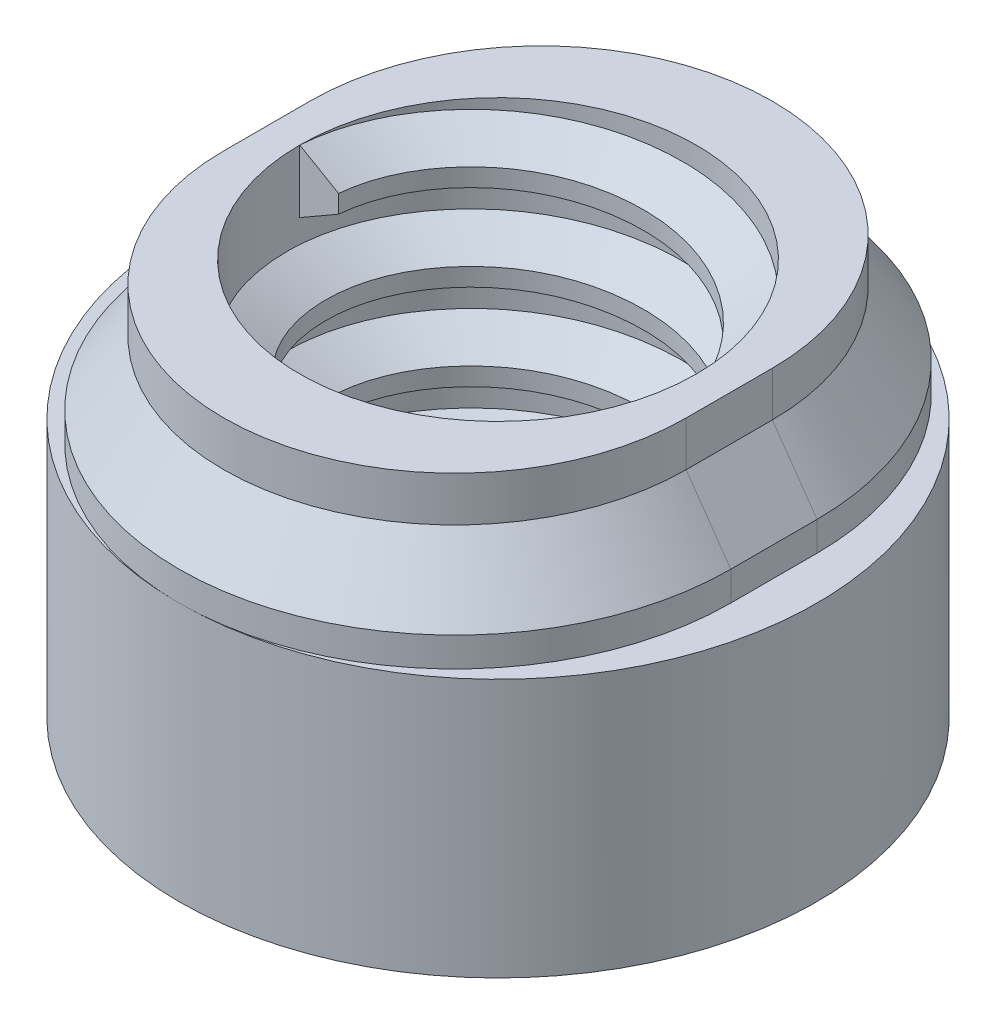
ISO-10303-21;
HEADER;
FILE_DESCRIPTION(('STEP AP214'),'2;1');
FILE_NAME('part.step','',(''),(''),'','','');
FILE_SCHEMA(('AUTOMOTIVE_DESIGN { 1 0 10303 214 1 1 1 1 }'));
ENDSEC;
DATA;
#1=APPLICATION_CONTEXT('core data for automotive mechanical design processes');
#2=APPLICATION_PROTOCOL_DEFINITION('international standard','automotive_design',2000,#1);
#3=PRODUCT_CONTEXT('',#1,'mechanical');
#4=PRODUCT('Part','Part','',(#3));
#5=PRODUCT_RELATED_PRODUCT_CATEGORY('part','',(#4));
#6=PRODUCT_DEFINITION_FORMATION('','',#4);
#7=PRODUCT_DEFINITION_CONTEXT('part definition',#1,'design');
#8=PRODUCT_DEFINITION('design','',#6,#7);
#9=PRODUCT_DEFINITION_SHAPE('','',#8);
#10=(LENGTH_UNIT() NAMED_UNIT(*) SI_UNIT(.MILLI.,.METRE.));
#11=(NAMED_UNIT(*) PLANE_ANGLE_UNIT() SI_UNIT($,.RADIAN.));
#12=(NAMED_UNIT(*) SI_UNIT($,.STERADIAN.) SOLID_ANGLE_UNIT());
#13=UNCERTAINTY_MEASURE_WITH_UNIT(LENGTH_MEASURE(1.E-05),#10,'distance_accuracy_value','');
#14=(GEOMETRIC_REPRESENTATION_CONTEXT(3) GLOBAL_UNCERTAINTY_ASSIGNED_CONTEXT((#13)) GLOBAL_UNIT_ASSIGNED_CONTEXT((#10,
#11,#12)) REPRESENTATION_CONTEXT('',''));
#15=CARTESIAN_POINT('',(0.,0.,0.));
#16=DIRECTION('',(0.,0.,1.));
#17=DIRECTION('',(1.,0.,0.));
#18=AXIS2_PLACEMENT_3D('',#15,#16,#17);
#19=CARTESIAN_POINT('',(6.35,3.81,68.58));
#20=DIRECTION('',(0.,-1.,0.));
#21=DIRECTION('',(0.,0.,-1.));
#22=AXIS2_PLACEMENT_3D('',#19,#20,#21);
#23=CYLINDRICAL_SURFACE('',#22,2.921);
#24=CARTESIAN_POINT('',(6.35,5.842,68.58));
#25=DIRECTION('',(0.,1.,0.));
#26=DIRECTION('',(0.,0.,1.));
#27=AXIS2_PLACEMENT_3D('',#24,#25,#26);
#28=CIRCLE('',#27,2.92100000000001);
#29=CARTESIAN_POINT('',(3.429,5.842,68.58));
#30=VERTEX_POINT('',#29);
#31=EDGE_CURVE('E551',#30,#30,#28,.T.);
#32=ORIENTED_EDGE('',*,*,#31,.T.);
#33=CARTESIAN_POINT('',(3.429,5.842,68.58));
#34=CARTESIAN_POINT('',(3.429,5.762625,67.3700821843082));
#35=CARTESIAN_POINT('',(4.28454109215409,5.68325,66.5145410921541));
#36=CARTESIAN_POINT('',(5.14008218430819,5.603875,65.659));
#37=CARTESIAN_POINT('',(6.35,5.5245,65.659));
#38=CARTESIAN_POINT('',(7.55991781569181,5.445125,65.659));
#39=CARTESIAN_POINT('',(8.4154589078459,5.36575,66.5145410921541));
#40=CARTESIAN_POINT('',(9.271,5.286375,67.3700821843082));
#41=CARTESIAN_POINT('',(9.271,5.207,68.58));
#42=CARTESIAN_POINT('',(9.271,5.127625,69.7899178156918));
#43=CARTESIAN_POINT('',(8.4154589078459,5.04825,70.6454589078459));
#44=CARTESIAN_POINT('',(7.55991781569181,4.968875,71.501));
#45=CARTESIAN_POINT('',(6.35,4.8895,71.501));
#46=CARTESIAN_POINT('',(5.14008218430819,4.810125,71.501));
#47=CARTESIAN_POINT('',(4.28454109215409,4.73075,70.6454589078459));
#48=CARTESIAN_POINT('',(3.429,4.651375,69.7899178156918));
#49=CARTESIAN_POINT('',(3.429,4.572,68.58));
#50=CARTESIAN_POINT('',(3.429,4.492625,67.3700821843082));
#51=CARTESIAN_POINT('',(4.28454109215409,4.41325,66.5145410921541));
#52=CARTESIAN_POINT('',(5.14008218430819,4.333875,65.659));
#53=CARTESIAN_POINT('',(6.35,4.2545,65.659));
#54=CARTESIAN_POINT('',(7.55991781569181,4.175125,65.659));
#55=CARTESIAN_POINT('',(8.4154589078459,4.09575,66.5145410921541));
#56=CARTESIAN_POINT('',(9.271,4.016375,67.3700821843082));
#57=CARTESIAN_POINT('',(9.271,3.937,68.58));
#58=CARTESIAN_POINT('',(9.271,3.857625,69.7899178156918));
#59=CARTESIAN_POINT('',(8.4154589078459,3.77825,70.6454589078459));
#60=CARTESIAN_POINT('',(7.55991781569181,3.698875,71.501));
#61=CARTESIAN_POINT('',(6.35,3.6195,71.501));
#62=CARTESIAN_POINT('',(5.14008218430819,3.540125,71.501));
#63=CARTESIAN_POINT('',(4.28454109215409,3.46075,70.6454589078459));
#64=CARTESIAN_POINT('',(3.429,3.381375,69.7899178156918));
#65=CARTESIAN_POINT('',(3.429,3.302,68.58));
#66=CARTESIAN_POINT('',(3.429,3.222625,67.3700821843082));
#67=CARTESIAN_POINT('',(4.28454109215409,3.14325,66.5145410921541));
#68=CARTESIAN_POINT('',(5.14008218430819,3.063875,65.659));
#69=CARTESIAN_POINT('',(6.35,2.9845,65.659));
#70=CARTESIAN_POINT('',(7.55991781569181,2.905125,65.659));
#71=CARTESIAN_POINT('',(8.4154589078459,2.82575,66.5145410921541));
#72=CARTESIAN_POINT('',(9.271,2.746375,67.3700821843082));
#73=CARTESIAN_POINT('',(9.271,2.667,68.58));
#74=CARTESIAN_POINT('',(9.271,2.587625,69.7899178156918));
#75=CARTESIAN_POINT('',(8.4154589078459,2.50825,70.6454589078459));
#76=CARTESIAN_POINT('',(7.55991781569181,2.428875,71.501));
#77=CARTESIAN_POINT('',(6.35,2.3495,71.501));
#78=CARTESIAN_POINT('',(5.14008218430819,2.270125,71.501));
#79=CARTESIAN_POINT('',(4.28454109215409,2.19075,70.6454589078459));
#80=CARTESIAN_POINT('',(3.429,2.111375,69.7899178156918));
#81=CARTESIAN_POINT('',(3.429,2.032,68.58));
#82=CARTESIAN_POINT('',(3.429,1.952625,67.3700821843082));
#83=CARTESIAN_POINT('',(4.28454109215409,1.87325,66.5145410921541));
#84=CARTESIAN_POINT('',(5.14008218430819,1.793875,65.659));
#85=CARTESIAN_POINT('',(6.35,1.7145,65.659));
#86=CARTESIAN_POINT('',(7.55991781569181,1.635125,65.659));
#87=CARTESIAN_POINT('',(8.4154589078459,1.55575,66.5145410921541));
#88=CARTESIAN_POINT('',(9.271,1.476375,67.3700821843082));
#89=CARTESIAN_POINT('',(9.271,1.397,68.58));
#90=CARTESIAN_POINT('',(9.271,1.317625,69.7899178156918));
#91=CARTESIAN_POINT('',(8.4154589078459,1.23825,70.6454589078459));
#92=CARTESIAN_POINT('',(7.55991781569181,1.158875,71.501));
#93=CARTESIAN_POINT('',(6.35,1.0795,71.501));
#94=CARTESIAN_POINT('',(5.14008218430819,1.000125,71.501));
#95=CARTESIAN_POINT('',(4.28454109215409,0.92075,70.6454589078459));
#96=CARTESIAN_POINT('',(3.429,0.841374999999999,69.7899178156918));
#97=CARTESIAN_POINT('',(3.429,0.762,68.58));
#98=CARTESIAN_POINT('',(3.429,0.682625,67.3700821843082));
#99=CARTESIAN_POINT('',(4.28454109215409,0.60325,66.5145410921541));
#100=CARTESIAN_POINT('',(5.14008218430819,0.523875,65.659));
#101=CARTESIAN_POINT('',(6.35,0.4445,65.659));
#102=CARTESIAN_POINT('',(7.55991781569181,0.365125,65.659));
#103=CARTESIAN_POINT('',(8.4154589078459,0.28575,66.5145410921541));
#104=CARTESIAN_POINT('',(9.271,0.206375,67.3700821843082));
#105=CARTESIAN_POINT('',(9.271,0.127,68.58));
#106=CARTESIAN_POINT('',(9.271,0.0476249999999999,69.7899178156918));
#107=CARTESIAN_POINT('',(8.4154589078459,-0.0317500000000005,70.6454589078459));
#108=CARTESIAN_POINT('',(7.55991781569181,-0.111125,71.501));
#109=CARTESIAN_POINT('',(6.35,-0.190500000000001,71.501));
#110=CARTESIAN_POINT('',(5.14008218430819,-0.269875,71.501));
#111=CARTESIAN_POINT('',(4.28454109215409,-0.349250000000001,70.6454589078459));
#112=CARTESIAN_POINT('',(3.429,-0.428625,69.7899178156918));
#113=CARTESIAN_POINT('',(3.429,-0.508000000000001,68.58));
#114=(BOUNDED_CURVE() B_SPLINE_CURVE(2,(#33,#34,#35,#36,#37,#38,#39,#40,#41,#42,#43,#44,#45,#46,
#47,#48,#49,#50,#51,#52,#53,#54,#55,#56,#57,#58,#59,#60,#61,#62,#63,#64,#65,#66,#67,#68,#69,#70,
#71,#72,#73,#74,#75,#76,#77,#78,#79,#80,#81,#82,#83,#84,#85,#86,#87,#88,#89,#90,#91,#92,#93,#94,
#95,#96,#97,#98,#99,#100,#101,#102,#103,#104,#105,#106,#107,#108,#109,#110,#111,#112,#113),
.UNSPECIFIED.,.F.,.F.) B_SPLINE_CURVE_WITH_KNOTS((3,2,2,2,2,2,2,2,2,2,2,2,2,2,2,2,2,2,2,2,2,2,2,
2,2,2,2,2,2,2,2,2,2,2,2,2,2,2,2,2,3),(0.,0.025,0.05,0.075,0.1,0.125,0.15,0.175,0.2,0.225,0.25,
0.275,0.3,0.325,0.35,0.375,0.4,0.425,0.45,0.475,0.5,0.525,0.55,0.575,0.6,0.625,0.65,0.675,0.7,
0.725,0.75,0.775,0.8,0.825,0.85,0.875,0.9,0.925,0.95,0.975,1.),
.UNSPECIFIED.) CURVE() GEOMETRIC_REPRESENTATION_ITEM() RATIONAL_B_SPLINE_CURVE((1.,
0.923879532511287,1.,0.923879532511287,1.,0.923879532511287,1.,0.923879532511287,1.,
0.923879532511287,1.,0.923879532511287,1.,0.923879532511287,1.,0.923879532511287,1.,
0.923879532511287,1.,0.923879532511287,1.,0.923879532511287,1.,0.923879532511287,1.,
0.923879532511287,1.,0.923879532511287,1.,0.923879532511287,1.,0.923879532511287,1.,
0.923879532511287,1.,0.923879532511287,1.,0.923879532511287,1.,0.923879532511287,1.,
0.923879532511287,1.,0.923879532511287,1.,0.923879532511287,1.,0.923879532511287,1.,
0.923879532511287,1.,0.923879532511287,1.,0.923879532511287,1.,0.923879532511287,1.,
0.923879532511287,1.,0.923879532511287,1.,0.923879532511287,1.,0.923879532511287,1.,
0.923879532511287,1.,0.923879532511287,1.,0.923879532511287,1.,0.923879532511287,1.,
0.923879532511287,1.,0.923879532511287,1.,0.923879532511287,1.,0.923879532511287,1.)) REPRESENTATION_ITEM(''));
#115=CARTESIAN_POINT('',(8.7198890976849,0.,70.2875908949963));
#116=VERTEX_POINT('',#115);
#117=EDGE_CURVE('E148',#30,#116,#114,.T.);
#118=ORIENTED_EDGE('',*,*,#117,.T.);
#119=CARTESIAN_POINT('',(6.35,0.,68.58));
#120=DIRECTION('',(0.,1.,0.));
#121=DIRECTION('',(0.,0.,1.));
#122=AXIS2_PLACEMENT_3D('',#119,#120,#121);
#123=CIRCLE('',#122,2.921);
#124=CARTESIAN_POINT('',(4.34203332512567,0.,70.7013936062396));
#125=VERTEX_POINT('',#124);
#126=EDGE_CURVE('E140',#125,#116,#123,.T.);
#127=ORIENTED_EDGE('',*,*,#126,.F.);
#128=CARTESIAN_POINT('',(3.429,4.91595833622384,68.58));
#129=CARTESIAN_POINT('',(3.429,4.83658333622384,67.3700821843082));
#130=CARTESIAN_POINT('',(4.28454109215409,4.75720833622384,66.5145410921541));
#131=CARTESIAN_POINT('',(5.14008218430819,4.67783333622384,65.659));
#132=CARTESIAN_POINT('',(6.35,4.59845833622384,65.659));
#133=CARTESIAN_POINT('',(7.55991781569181,4.51908333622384,65.659));
#134=CARTESIAN_POINT('',(8.4154589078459,4.43970833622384,66.5145410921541));
#135=CARTESIAN_POINT('',(9.271,4.36033333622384,67.3700821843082));
#136=CARTESIAN_POINT('',(9.271,4.28095833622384,68.58));
#137=CARTESIAN_POINT('',(9.271,4.20158333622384,69.7899178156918));
#138=CARTESIAN_POINT('',(8.4154589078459,4.12220833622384,70.6454589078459));
#139=CARTESIAN_POINT('',(7.55991781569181,4.04283333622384,71.501));
#140=CARTESIAN_POINT('',(6.35,3.96345833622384,71.501));
#141=CARTESIAN_POINT('',(5.14008218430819,3.88408333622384,71.501));
#142=CARTESIAN_POINT('',(4.28454109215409,3.80470833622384,70.6454589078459));
#143=CARTESIAN_POINT('',(3.429,3.72533333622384,69.7899178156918));
#144=CARTESIAN_POINT('',(3.429,3.64595833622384,68.58));
#145=CARTESIAN_POINT('',(3.429,3.56658333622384,67.3700821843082));
#146=CARTESIAN_POINT('',(4.28454109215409,3.48720833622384,66.5145410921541));
#147=CARTESIAN_POINT('',(5.14008218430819,3.40783333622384,65.659));
#148=CARTESIAN_POINT('',(6.35,3.32845833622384,65.659));
#149=CARTESIAN_POINT('',(7.55991781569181,3.24908333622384,65.659));
#150=CARTESIAN_POINT('',(8.4154589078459,3.16970833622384,66.5145410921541));
#151=CARTESIAN_POINT('',(9.271,3.09033333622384,67.3700821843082));
#152=CARTESIAN_POINT('',(9.271,3.01095833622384,68.58));
#153=CARTESIAN_POINT('',(9.271,2.93158333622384,69.7899178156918));
#154=CARTESIAN_POINT('',(8.4154589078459,2.85220833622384,70.6454589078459));
#155=CARTESIAN_POINT('',(7.55991781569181,2.77283333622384,71.501));
#156=CARTESIAN_POINT('',(6.35,2.69345833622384,71.501));
#157=CARTESIAN_POINT('',(5.14008218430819,2.61408333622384,71.501));
#158=CARTESIAN_POINT('',(4.28454109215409,2.53470833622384,70.6454589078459));
#159=CARTESIAN_POINT('',(3.429,2.45533333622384,69.7899178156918));
#160=CARTESIAN_POINT('',(3.429,2.37595833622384,68.58));
#161=CARTESIAN_POINT('',(3.429,2.29658333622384,67.3700821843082));
#162=CARTESIAN_POINT('',(4.28454109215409,2.21720833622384,66.5145410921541));
#163=CARTESIAN_POINT('',(5.14008218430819,2.13783333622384,65.659));
#164=CARTESIAN_POINT('',(6.35,2.05845833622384,65.659));
#165=CARTESIAN_POINT('',(7.55991781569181,1.97908333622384,65.659));
#166=CARTESIAN_POINT('',(8.4154589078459,1.89970833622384,66.5145410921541));
#167=CARTESIAN_POINT('',(9.271,1.82033333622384,67.3700821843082));
#168=CARTESIAN_POINT('',(9.271,1.74095833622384,68.58));
#169=CARTESIAN_POINT('',(9.271,1.66158333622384,69.7899178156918));
#170=CARTESIAN_POINT('',(8.4154589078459,1.58220833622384,70.6454589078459));
#171=CARTESIAN_POINT('',(7.55991781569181,1.50283333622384,71.501));
#172=CARTESIAN_POINT('',(6.35,1.42345833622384,71.501));
#173=CARTESIAN_POINT('',(5.14008218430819,1.34408333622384,71.501));
#174=CARTESIAN_POINT('',(4.28454109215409,1.26470833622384,70.6454589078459));
#175=CARTESIAN_POINT('',(3.429,1.18533333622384,69.7899178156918));
#176=CARTESIAN_POINT('',(3.429,1.10595833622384,68.58));
#177=CARTESIAN_POINT('',(3.429,1.02658333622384,67.3700821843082));
#178=CARTESIAN_POINT('',(4.28454109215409,0.947208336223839,66.5145410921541));
#179=CARTESIAN_POINT('',(5.14008218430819,0.867833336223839,65.659));
#180=CARTESIAN_POINT('',(6.35,0.788458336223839,65.659));
#181=CARTESIAN_POINT('',(7.55991781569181,0.709083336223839,65.659));
#182=CARTESIAN_POINT('',(8.4154589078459,0.629708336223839,66.5145410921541));
#183=CARTESIAN_POINT('',(9.271,0.550333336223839,67.3700821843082));
#184=CARTESIAN_POINT('',(9.271,0.470958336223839,68.58));
#185=CARTESIAN_POINT('',(9.271,0.391583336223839,69.7899178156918));
#186=CARTESIAN_POINT('',(8.4154589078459,0.312208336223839,70.6454589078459));
#187=CARTESIAN_POINT('',(7.55991781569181,0.232833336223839,71.501));
#188=CARTESIAN_POINT('',(6.35,0.153458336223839,71.501));
#189=CARTESIAN_POINT('',(5.14008218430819,0.0740833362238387,71.501));
#190=CARTESIAN_POINT('',(4.28454109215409,-0.00529166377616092,70.6454589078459));
#191=CARTESIAN_POINT('',(3.429,-0.0846666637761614,69.7899178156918));
#192=CARTESIAN_POINT('',(3.429,-0.164041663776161,68.58));
#193=CARTESIAN_POINT('',(3.429,-0.243416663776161,67.3700821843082));
#194=CARTESIAN_POINT('',(4.28454109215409,-0.322791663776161,66.5145410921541));
#195=CARTESIAN_POINT('',(5.14008218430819,-0.402166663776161,65.659));
#196=CARTESIAN_POINT('',(6.35,-0.481541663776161,65.659));
#197=CARTESIAN_POINT('',(7.55991781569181,-0.560916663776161,65.659));
#198=CARTESIAN_POINT('',(8.4154589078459,-0.640291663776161,66.5145410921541));
#199=CARTESIAN_POINT('',(9.271,-0.719666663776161,67.3700821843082));
#200=CARTESIAN_POINT('',(9.271,-0.799041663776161,68.58));
#201=CARTESIAN_POINT('',(9.271,-0.878416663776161,69.7899178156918));
#202=CARTESIAN_POINT('',(8.4154589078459,-0.957791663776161,70.6454589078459));
#203=CARTESIAN_POINT('',(7.55991781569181,-1.03716666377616,71.501));
#204=CARTESIAN_POINT('',(6.35,-1.11654166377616,71.501));
#205=CARTESIAN_POINT('',(5.14008218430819,-1.19591666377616,71.501));
#206=CARTESIAN_POINT('',(4.28454109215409,-1.27529166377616,70.6454589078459));
#207=CARTESIAN_POINT('',(3.429,-1.35466666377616,69.7899178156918));
#208=CARTESIAN_POINT('',(3.429,-1.43404166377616,68.58));
#209=(BOUNDED_CURVE() B_SPLINE_CURVE(2,(#128,#129,#130,#131,#132,#133,#134,#135,#136,#137,#138,
#139,#140,#141,#142,#143,#144,#145,#146,#147,#148,#149,#150,#151,#152,#153,#154,#155,#156,#157,
#158,#159,#160,#161,#162,#163,#164,#165,#166,#167,#168,#169,#170,#171,#172,#173,#174,#175,#176,
#177,#178,#179,#180,#181,#182,#183,#184,#185,#186,#187,#188,#189,#190,#191,#192,#193,#194,#195,
#196,#197,#198,#199,#200,#201,#202,#203,#204,#205,#206,#207,#208),.UNSPECIFIED.,.F.,
.F.) B_SPLINE_CURVE_WITH_KNOTS((3,2,2,2,2,2,2,2,2,2,2,2,2,2,2,2,2,2,2,2,2,2,2,2,2,2,2,2,2,2,2,2,
2,2,2,2,2,2,2,2,3),(0.,0.025,0.05,0.075,0.1,0.125,0.15,0.175,0.2,0.225,0.25,0.275,0.3,0.325,
0.35,0.375,0.4,0.425,0.45,0.475,0.5,0.525,0.55,0.575,0.6,0.625,0.65,0.675,0.7,0.725,0.75,0.775,
0.8,0.825,0.85,0.875,0.9,0.925,0.95,0.975,1.),
.UNSPECIFIED.) CURVE() GEOMETRIC_REPRESENTATION_ITEM() RATIONAL_B_SPLINE_CURVE((1.,
0.923879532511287,1.,0.923879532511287,1.,0.923879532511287,1.,0.923879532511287,1.,
0.923879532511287,1.,0.923879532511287,1.,0.923879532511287,1.,0.923879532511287,1.,
0.923879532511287,1.,0.923879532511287,1.,0.923879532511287,1.,0.923879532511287,1.,
0.923879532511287,1.,0.923879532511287,1.,0.923879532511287,1.,0.923879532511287,1.,
0.923879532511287,1.,0.923879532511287,1.,0.923879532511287,1.,0.923879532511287,1.,
0.923879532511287,1.,0.923879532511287,1.,0.923879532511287,1.,0.923879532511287,1.,
0.923879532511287,1.,0.923879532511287,1.,0.923879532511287,1.,0.923879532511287,1.,
0.923879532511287,1.,0.923879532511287,1.,0.923879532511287,1.,0.923879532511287,1.,
0.923879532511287,1.,0.923879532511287,1.,0.923879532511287,1.,0.923879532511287,1.,
0.923879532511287,1.,0.923879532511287,1.,0.923879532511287,1.,0.923879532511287,1.)) REPRESENTATION_ITEM(''));
#210=CARTESIAN_POINT('',(3.429,4.91595833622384,68.58));
#211=VERTEX_POINT('',#210);
#212=EDGE_CURVE('E143',#211,#125,#209,.T.);
#213=ORIENTED_EDGE('',*,*,#212,.F.);
#214=DIRECTION('',(0.,-1.,0.));
#215=VECTOR('',#214,1.);
#216=CARTESIAN_POINT('',(3.429,5.37897916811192,68.58));
#217=LINE('',#216,#215);
#218=EDGE_CURVE('E149',#30,#211,#217,.T.);
#219=ORIENTED_EDGE('',*,*,#218,.F.);
#220=EDGE_LOOP('',(#32,#118,#127,#213,#219));
#221=FACE_BOUND('',#220,.T.);
#222=ADVANCED_FACE('F38',(#221),#23,.F.);
#223=CARTESIAN_POINT('',(6.35,3.81,68.58));
#224=DIRECTION('',(0.,1.,0.));
#225=DIRECTION('',(0.,0.,1.));
#226=AXIS2_PLACEMENT_3D('',#223,#224,#225);
#227=PLANE('',#226);
#228=DIRECTION('',(0.,0.,1.));
#229=VECTOR('',#228,1.);
#230=CARTESIAN_POINT('',(2.286,3.81,69.2149999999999));
#231=LINE('',#230,#229);
#232=CARTESIAN_POINT('',(2.286,3.81,67.9450000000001));
#233=VERTEX_POINT('',#232);
#234=CARTESIAN_POINT('',(2.286,3.81,69.2149999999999));
#235=VERTEX_POINT('',#234);
#236=EDGE_CURVE('E239',#233,#235,#231,.T.);
#237=ORIENTED_EDGE('',*,*,#236,.F.);
#238=CARTESIAN_POINT('',(6.35,3.81,67.9450000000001));
#239=DIRECTION('',(0.,1.,0.));
#240=DIRECTION('',(0.,0.,1.));
#241=AXIS2_PLACEMENT_3D('',#238,#239,#240);
#242=CIRCLE('',#241,4.064);
#243=CARTESIAN_POINT('',(6.35,3.81,63.881));
#244=VERTEX_POINT('',#243);
#245=EDGE_CURVE('E176',#244,#233,#242,.T.);
#246=ORIENTED_EDGE('',*,*,#245,.F.);
#247=CARTESIAN_POINT('',(6.35,3.81,68.58));
#248=DIRECTION('',(0.,1.,0.));
#249=DIRECTION('',(0.,0.,1.));
#250=AXIS2_PLACEMENT_3D('',#247,#248,#249);
#251=CIRCLE('',#250,4.699);
#252=CARTESIAN_POINT('',(6.35,3.81,73.279));
#253=VERTEX_POINT('',#252);
#254=EDGE_CURVE('E160',#244,#253,#251,.T.);
#255=ORIENTED_EDGE('',*,*,#254,.T.);
#256=CARTESIAN_POINT('',(6.35,3.81,69.2149999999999));
#257=DIRECTION('',(0.,1.,0.));
#258=DIRECTION('',(0.,0.,1.));
#259=AXIS2_PLACEMENT_3D('',#256,#257,#258);
#260=CIRCLE('',#259,4.064);
#261=EDGE_CURVE('E213',#235,#253,#260,.T.);
#262=ORIENTED_EDGE('',*,*,#261,.F.);
#263=EDGE_LOOP('',(#237,#246,#255,#262));
#264=FACE_BOUND('',#263,.T.);
#265=ADVANCED_FACE('F284',(#264),#227,.T.);
#266=CARTESIAN_POINT('',(10.414,3.81,69.2149999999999));
#267=VERTEX_POINT('',#266);
#268=EDGE_CURVE('E169',#253,#267,#260,.T.);
#269=ORIENTED_EDGE('',*,*,#268,.F.);
#270=EDGE_CURVE('E166',#253,#244,#251,.T.);
#271=ORIENTED_EDGE('',*,*,#270,.T.);
#272=CARTESIAN_POINT('',(10.414,3.81,67.9450000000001));
#273=VERTEX_POINT('',#272);
#274=EDGE_CURVE('E226',#273,#244,#242,.T.);
#275=ORIENTED_EDGE('',*,*,#274,.F.);
#276=DIRECTION('',(0.,0.,-1.));
#277=VECTOR('',#276,1.);
#278=CARTESIAN_POINT('',(10.414,3.81,69.2149999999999));
#279=LINE('',#278,#277);
#280=EDGE_CURVE('E219',#267,#273,#279,.T.);
#281=ORIENTED_EDGE('',*,*,#280,.F.);
#282=EDGE_LOOP('',(#269,#271,#275,#281));
#283=FACE_BOUND('',#282,.T.);
#284=ADVANCED_FACE('F259',(#283),#227,.T.);
#285=CARTESIAN_POINT('',(6.35,0.,68.58));
#286=DIRECTION('',(0.,1.,0.));
#287=DIRECTION('',(0.,0.,1.));
#288=AXIS2_PLACEMENT_3D('',#285,#286,#287);
#289=PLANE('',#288);
#290=CARTESIAN_POINT('',(6.35,0.,68.58));
#291=DIRECTION('',(0.,1.,0.));
#292=DIRECTION('',(0.,0.,1.));
#293=AXIS2_PLACEMENT_3D('',#290,#291,#292);
#294=CIRCLE('',#293,4.699);
#295=CARTESIAN_POINT('',(6.35,0.,73.279));
#296=VERTEX_POINT('',#295);
#297=EDGE_CURVE('E154',#296,#296,#294,.T.);
#298=ORIENTED_EDGE('',*,*,#297,.F.);
#299=EDGE_LOOP('',(#298));
#300=FACE_BOUND('',#299,.T.);
#301=ORIENTED_EDGE('',*,*,#126,.T.);
#302=CARTESIAN_POINT('',(7.59591374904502,0.,66.5896342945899));
#303=CARTESIAN_POINT('',(7.65057499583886,0.,66.61335277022));
#304=CARTESIAN_POINT('',(7.70430342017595,0.,66.6392442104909));
#305=CARTESIAN_POINT('',(7.80950996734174,0.,66.6951395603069));
#306=CARTESIAN_POINT('',(7.86099023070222,0.,66.7251394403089));
#307=CARTESIAN_POINT('',(7.93629251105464,0.,66.7730693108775));
#308=CARTESIAN_POINT('',(7.96106279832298,0.,66.7895261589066));
#309=CARTESIAN_POINT('',(8.00993444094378,0.,66.8234053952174));
#310=CARTESIAN_POINT('',(8.03403582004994,0.,66.8408277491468));
#311=CARTESIAN_POINT('',(8.08156781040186,0.,66.8765747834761));
#312=CARTESIAN_POINT('',(8.10499825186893,0.,66.8948996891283));
#313=CARTESIAN_POINT('',(8.15121729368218,0.,66.9323466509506));
#314=CARTESIAN_POINT('',(8.17400577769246,0.,66.9514688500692));
#315=CARTESIAN_POINT('',(8.24570904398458,0.,67.0138235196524));
#316=CARTESIAN_POINT('',(8.29332127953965,0.,67.0585753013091));
#317=CARTESIAN_POINT('',(8.38495781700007,0.,67.1516072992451));
#318=CARTESIAN_POINT('',(8.42898118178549,0.,67.1998884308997));
#319=CARTESIAN_POINT('',(8.55530212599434,0.,67.3496635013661));
#320=CARTESIAN_POINT('',(8.63185766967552,0.,67.4560953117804));
#321=CARTESIAN_POINT('',(8.77394863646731,0.,67.6898375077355));
#322=CARTESIAN_POINT('',(8.83781532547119,0.,67.8181682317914));
#323=CARTESIAN_POINT('',(8.91677431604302,0.,68.0171528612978));
#324=CARTESIAN_POINT('',(8.9402916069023,0.,68.0845834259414));
#325=CARTESIAN_POINT('',(8.98158715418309,0.,68.2211974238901));
#326=CARTESIAN_POINT('',(8.99936629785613,0.,68.2903805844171));
#327=CARTESIAN_POINT('',(9.02163723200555,0.,68.3950464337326));
#328=CARTESIAN_POINT('',(9.02832716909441,0.,68.4300776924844));
#329=CARTESIAN_POINT('',(9.0402213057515,0.,68.5003938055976));
#330=CARTESIAN_POINT('',(9.0454255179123,0.,68.5356786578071));
#331=CARTESIAN_POINT('',(9.05440347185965,0.,68.6064337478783));
#332=CARTESIAN_POINT('',(9.05817698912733,0.,68.6419040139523));
#333=CARTESIAN_POINT('',(9.06439866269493,0.,68.7129590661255));
#334=CARTESIAN_POINT('',(9.06684677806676,0.,68.748543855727));
#335=CARTESIAN_POINT('',(9.07215848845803,0.,68.8554793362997));
#336=CARTESIAN_POINT('',(9.07298107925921,0.,68.9269449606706));
#337=CARTESIAN_POINT('',(9.06920244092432,0.,69.0696993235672));
#338=CARTESIAN_POINT('',(9.06460187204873,0.,69.1409880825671));
#339=CARTESIAN_POINT('',(9.04151205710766,0.,69.3653267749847));
#340=CARTESIAN_POINT('',(9.0131093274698,0.,69.5174709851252));
#341=CARTESIAN_POINT('',(8.93184655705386,0.,69.8147704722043));
#342=CARTESIAN_POINT('',(8.87903757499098,0.,69.9599396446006));
#343=CARTESIAN_POINT('',(8.80019934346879,0.,70.1315832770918));
#344=CARTESIAN_POINT('',(8.7849433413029,0.,70.1632218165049));
#345=CARTESIAN_POINT('',(8.7532789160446,0.,70.2258721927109));
#346=CARTESIAN_POINT('',(8.73687180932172,0.,70.2568846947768));
#347=CARTESIAN_POINT('',(8.71988909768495,0.,70.2875908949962));
#348=B_SPLINE_CURVE_WITH_KNOTS('',3,(#302,#303,#304,#305,#306,#307,#308,#309,#310,#311,#312,
#313,#314,#315,#316,#317,#318,#319,#320,#321,#322,#323,#324,#325,#326,#327,#328,#329,#330,#331,
#332,#333,#334,#335,#336,#337,#338,#339,#340,#341,#342,#343,#344,#345,#346,#347),.UNSPECIFIED.,
.F.,.F.,(4,2,2,2,2,2,2,2,2,2,2,2,2,2,2,2,2,2,2,2,2,2,4),(0.,0.178729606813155,0.357285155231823,
0.446482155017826,0.535675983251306,0.624892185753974,0.714124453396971,0.909929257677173,
1.10578502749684,1.49746856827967,1.92529481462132,2.13933474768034,2.35334156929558,
2.4603095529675,2.56727662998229,2.67426048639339,2.78124764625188,2.99542157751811,
3.20956943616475,3.67167354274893,4.13281525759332,4.23817553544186,4.34341723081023),.UNSPECIFIED.);
#349=CARTESIAN_POINT('',(7.59591374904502,0.,66.5896342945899));
#350=VERTEX_POINT('',#349);
#351=EDGE_CURVE('E506',#350,#116,#348,.T.);
#352=ORIENTED_EDGE('',*,*,#351,.F.);
#353=CARTESIAN_POINT('',(4.7591966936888,-2.03561591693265E-13,66.8528052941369));
#354=CARTESIAN_POINT('',(4.82459237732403,0.,66.792555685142));
#355=CARTESIAN_POINT('',(4.89339965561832,0.,66.7360682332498));
#356=CARTESIAN_POINT('',(5.03706679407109,0.,66.6311609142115));
#357=CARTESIAN_POINT('',(5.11193536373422,0.,66.5827529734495));
#358=CARTESIAN_POINT('',(5.30406107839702,0.,66.4735190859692));
#359=CARTESIAN_POINT('',(5.42435926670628,0.,66.4179499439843));
#360=CARTESIAN_POINT('',(5.67258419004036,0.,66.3277962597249));
#361=CARTESIAN_POINT('',(5.80051378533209,0.,66.2932196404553));
#362=CARTESIAN_POINT('',(6.06031920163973,0.,66.2460417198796));
#363=CARTESIAN_POINT('',(6.19219342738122,0.,66.2334316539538));
#364=CARTESIAN_POINT('',(6.45624725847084,0.,66.2305308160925));
#365=CARTESIAN_POINT('',(6.58842696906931,0.,66.240249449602));
#366=CARTESIAN_POINT('',(6.84935761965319,0.,66.2817444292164));
#367=CARTESIAN_POINT('',(6.97810573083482,0.,66.3135384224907));
#368=CARTESIAN_POINT('',(7.22826936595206,0.,66.3982865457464));
#369=CARTESIAN_POINT('',(7.34969917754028,0.,66.4511977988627));
#370=CARTESIAN_POINT('',(7.48778044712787,0.,66.5257484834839));
#371=CARTESIAN_POINT('',(7.50970765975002,0.,66.5380476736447));
#372=CARTESIAN_POINT('',(7.55312962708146,0.,66.5633285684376));
#373=CARTESIAN_POINT('',(7.57462487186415,0.,66.5763094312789));
#374=CARTESIAN_POINT('',(7.59591374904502,0.,66.5896342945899));
#375=B_SPLINE_CURVE_WITH_KNOTS('',3,(#353,#354,#355,#356,#357,#358,#359,#360,#361,#362,#363,
#364,#365,#366,#367,#368,#369,#370,#371,#372,#373,#374),.UNSPECIFIED.,.F.,.F.,(4,2,2,2,2,2,2,2,
2,2,4),(0.,0.266536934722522,0.533463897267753,0.929018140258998,1.324721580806,
1.72026710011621,2.11597926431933,2.51200812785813,2.90723694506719,2.98265485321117,
3.05798172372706),.UNSPECIFIED.);
#376=CARTESIAN_POINT('',(4.75919669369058,-4.04328465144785E-13,66.8528052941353));
#377=VERTEX_POINT('',#376);
#378=EDGE_CURVE('E60',#377,#350,#375,.T.);
#379=ORIENTED_EDGE('',*,*,#378,.F.);
#380=CARTESIAN_POINT('',(4.34203332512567,0.,70.7013936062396));
#381=CARTESIAN_POINT('',(4.3294194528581,0.,70.6863608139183));
#382=CARTESIAN_POINT('',(4.31694168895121,0.,70.6712129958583));
#383=CARTESIAN_POINT('',(4.29228885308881,0.,70.6406742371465));
#384=CARTESIAN_POINT('',(4.28011376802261,0.,70.6252833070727));
#385=CARTESIAN_POINT('',(4.24408732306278,0.,70.5787251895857));
#386=CARTESIAN_POINT('',(4.22073402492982,0.,70.5471717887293));
#387=CARTESIAN_POINT('',(4.15272444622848,0.,70.4510682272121));
#388=CARTESIAN_POINT('',(4.11010528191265,0.,70.3850590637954));
#389=CARTESIAN_POINT('',(4.03071521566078,0.,70.2497602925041));
#390=CARTESIAN_POINT('',(3.99393542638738,0.,70.1804758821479));
#391=CARTESIAN_POINT('',(3.92640927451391,0.,70.0390237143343));
#392=CARTESIAN_POINT('',(3.89566291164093,0.,69.9668559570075));
#393=CARTESIAN_POINT('',(3.84049229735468,0.,69.8203118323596));
#394=CARTESIAN_POINT('',(3.8160552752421,0.,69.7459402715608));
#395=CARTESIAN_POINT('',(3.77360260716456,0.,69.5953867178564));
#396=CARTESIAN_POINT('',(3.75558693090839,0.,69.5192047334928));
#397=CARTESIAN_POINT('',(3.72610232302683,0.,69.3655390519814));
#398=CARTESIAN_POINT('',(3.71463708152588,0.,69.2880546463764));
#399=CARTESIAN_POINT('',(3.69835160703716,0.,69.1323831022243));
#400=CARTESIAN_POINT('',(3.69353223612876,0.,69.0541958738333));
#401=CARTESIAN_POINT('',(3.69058859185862,0.,68.8984109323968));
#402=CARTESIAN_POINT('',(3.69240266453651,0.,68.8208144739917));
#403=CARTESIAN_POINT('',(3.70002711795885,0.,68.7047667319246));
#404=CARTESIAN_POINT('',(3.70338616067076,0.,68.6661397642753));
#405=CARTESIAN_POINT('',(3.71172754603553,0.,68.5890621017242));
#406=CARTESIAN_POINT('',(3.7167098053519,0.,68.5506113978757));
#407=CARTESIAN_POINT('',(3.73435706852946,0.,68.4357434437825));
#408=CARTESIAN_POINT('',(3.74972767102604,0.,68.35972286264));
#409=CARTESIAN_POINT('',(3.78748146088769,0.,68.2094599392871));
#410=CARTESIAN_POINT('',(3.80986440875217,0.,68.1352175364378));
#411=CARTESIAN_POINT('',(3.86002802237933,0.,67.9932600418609));
#412=CARTESIAN_POINT('',(3.88743439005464,0.,67.9254126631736));
#413=CARTESIAN_POINT('',(3.94813648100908,0.,67.7924039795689));
#414=CARTESIAN_POINT('',(3.98143239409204,0.,67.7272427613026));
#415=CARTESIAN_POINT('',(4.05367465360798,0.,67.6000985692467));
#416=CARTESIAN_POINT('',(4.09262280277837,0.,67.5381166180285));
#417=CARTESIAN_POINT('',(4.17583532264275,0.,67.4178687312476));
#418=CARTESIAN_POINT('',(4.2200987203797,0.,67.3596021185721));
#419=CARTESIAN_POINT('',(4.33829209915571,0.,67.2175729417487));
#420=CARTESIAN_POINT('',(4.41557055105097,0.,67.1365406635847));
#421=CARTESIAN_POINT('',(4.5390245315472,0.,67.0235165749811));
#422=CARTESIAN_POINT('',(4.58140598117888,0.,66.9872805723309));
#423=CARTESIAN_POINT('',(4.64672268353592,0.,66.9350977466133));
#424=CARTESIAN_POINT('',(4.66878878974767,0.,66.9180631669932));
#425=CARTESIAN_POINT('',(4.7135305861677,0.,66.8848036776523));
#426=CARTESIAN_POINT('',(4.73620642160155,0.,66.8685789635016));
#427=CARTESIAN_POINT('',(4.75919669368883,-2.06897071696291E-13,66.8528052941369));
#428=B_SPLINE_CURVE_WITH_KNOTS('',3,(#380,#381,#382,#383,#384,#385,#386,#387,#388,#389,#390,
#391,#392,#393,#394,#395,#396,#397,#398,#399,#400,#401,#402,#403,#404,#405,#406,#407,#408,#409,
#410,#411,#412,#413,#414,#415,#416,#417,#418,#419,#420,#421,#422,#423,#424,#425,#426,#427),
.UNSPECIFIED.,.F.,.F.,(4,2,2,2,2,2,2,2,2,2,2,2,2,2,2,2,2,2,2,2,2,2,2,4),(0.,0.0588715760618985,
0.117740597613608,0.235475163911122,0.47088309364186,0.705929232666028,0.940975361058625,
1.17554193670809,1.41010740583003,1.64480488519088,1.87953280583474,2.11208463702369,
2.22837392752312,2.34465724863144,2.57696201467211,2.80925884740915,3.0284932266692,
3.24773467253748,3.46704619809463,3.6863176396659,4.02104936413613,4.18822745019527,
4.27183922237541,4.35547108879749),.UNSPECIFIED.);
#429=EDGE_CURVE('E11',#125,#377,#428,.T.);
#430=ORIENTED_EDGE('',*,*,#429,.F.);
#431=EDGE_LOOP('',(#301,#352,#379,#430));
#432=FACE_BOUND('',#431,.T.);
#433=ADVANCED_FACE('F138',(#300,#432),#289,.F.);
#434=CARTESIAN_POINT('',(6.35,3.81,68.58));
#435=DIRECTION('',(0.,-1.,0.));
#436=DIRECTION('',(0.,0.,-1.));
#437=AXIS2_PLACEMENT_3D('',#434,#435,#436);
#438=CYLINDRICAL_SURFACE('',#437,4.699);
#439=ORIENTED_EDGE('',*,*,#270,.F.);
#440=ORIENTED_EDGE('',*,*,#254,.F.);
#441=EDGE_LOOP('',(#439,#440));
#442=FACE_BOUND('',#441,.T.);
#443=ORIENTED_EDGE('',*,*,#297,.T.);
#444=EDGE_LOOP('',(#443));
#445=FACE_BOUND('',#444,.T.);
#446=ADVANCED_FACE('F297',(#442,#445),#438,.T.);
#447=CARTESIAN_POINT('',(6.35,5.1816,69.2149999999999));
#448=DIRECTION('',(0.,-1.,0.));
#449=DIRECTION('',(0.,0.,-1.));
#450=AXIS2_PLACEMENT_3D('',#447,#448,#449);
#451=CYLINDRICAL_SURFACE('',#450,4.064);
#452=DIRECTION('',(0.,-1.,0.));
#453=VECTOR('',#452,1.);
#454=CARTESIAN_POINT('',(10.414,5.1816,69.2149999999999));
#455=LINE('',#454,#453);
#456=CARTESIAN_POINT('',(10.414,4.2418,69.2149999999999));
#457=VERTEX_POINT('',#456);
#458=EDGE_CURVE('E155',#457,#267,#455,.T.);
#459=ORIENTED_EDGE('',*,*,#458,.F.);
#460=CARTESIAN_POINT('',(6.35,4.2418,69.2149999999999));
#461=DIRECTION('',(0.,1.,0.));
#462=DIRECTION('',(0.,0.,1.));
#463=AXIS2_PLACEMENT_3D('',#460,#461,#462);
#464=CIRCLE('',#463,4.064);
#465=CARTESIAN_POINT('',(2.286,4.2418,69.2149999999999));
#466=VERTEX_POINT('',#465);
#467=EDGE_CURVE('E53',#457,#466,#464,.F.);
#468=ORIENTED_EDGE('',*,*,#467,.T.);
#469=DIRECTION('',(0.,-1.,0.));
#470=VECTOR('',#469,1.);
#471=CARTESIAN_POINT('',(2.286,5.1816,69.2149999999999));
#472=LINE('',#471,#470);
#473=EDGE_CURVE('E243',#466,#235,#472,.T.);
#474=ORIENTED_EDGE('',*,*,#473,.T.);
#475=ORIENTED_EDGE('',*,*,#261,.T.);
#476=ORIENTED_EDGE('',*,*,#268,.T.);
#477=EDGE_LOOP('',(#459,#468,#474,#475,#476));
#478=FACE_BOUND('',#477,.T.);
#479=ADVANCED_FACE('F263',(#478),#451,.T.);
#480=CARTESIAN_POINT('',(10.414,5.1816,69.2149999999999));
#481=DIRECTION('',(-1.,0.,0.));
#482=DIRECTION('',(0.,0.,1.));
#483=AXIS2_PLACEMENT_3D('',#480,#481,#482);
#484=PLANE('',#483);
#485=DIRECTION('',(0.,-1.,0.));
#486=VECTOR('',#485,1.);
#487=CARTESIAN_POINT('',(10.414,5.1816,67.9450000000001));
#488=LINE('',#487,#486);
#489=CARTESIAN_POINT('',(10.414,4.2418,67.9450000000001));
#490=VERTEX_POINT('',#489);
#491=EDGE_CURVE('E162',#490,#273,#488,.T.);
#492=ORIENTED_EDGE('',*,*,#491,.F.);
#493=DIRECTION('',(0.,0.,1.));
#494=VECTOR('',#493,1.);
#495=CARTESIAN_POINT('',(10.414,4.2418,69.2149999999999));
#496=LINE('',#495,#494);
#497=EDGE_CURVE('E195',#490,#457,#496,.T.);
#498=ORIENTED_EDGE('',*,*,#497,.T.);
#499=ORIENTED_EDGE('',*,*,#458,.T.);
#500=ORIENTED_EDGE('',*,*,#280,.T.);
#501=EDGE_LOOP('',(#492,#498,#499,#500));
#502=FACE_BOUND('',#501,.T.);
#503=ADVANCED_FACE('F261',(#502),#484,.F.);
#504=CARTESIAN_POINT('',(6.35,5.1816,67.9450000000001));
#505=DIRECTION('',(0.,-1.,0.));
#506=DIRECTION('',(0.,0.,-1.));
#507=AXIS2_PLACEMENT_3D('',#504,#505,#506);
#508=CYLINDRICAL_SURFACE('',#507,4.064);
#509=DIRECTION('',(0.,-1.,0.));
#510=VECTOR('',#509,1.);
#511=CARTESIAN_POINT('',(2.286,5.1816,67.9450000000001));
#512=LINE('',#511,#510);
#513=CARTESIAN_POINT('',(2.286,4.2418,67.9450000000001));
#514=VERTEX_POINT('',#513);
#515=EDGE_CURVE('E248',#514,#233,#512,.T.);
#516=ORIENTED_EDGE('',*,*,#515,.F.);
#517=CARTESIAN_POINT('',(6.35,4.2418,67.9450000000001));
#518=DIRECTION('',(0.,1.,0.));
#519=DIRECTION('',(0.,0.,1.));
#520=AXIS2_PLACEMENT_3D('',#517,#518,#519);
#521=CIRCLE('',#520,4.064);
#522=EDGE_CURVE('E188',#514,#490,#521,.F.);
#523=ORIENTED_EDGE('',*,*,#522,.T.);
#524=ORIENTED_EDGE('',*,*,#491,.T.);
#525=ORIENTED_EDGE('',*,*,#274,.T.);
#526=ORIENTED_EDGE('',*,*,#245,.T.);
#527=EDGE_LOOP('',(#516,#523,#524,#525,#526));
#528=FACE_BOUND('',#527,.T.);
#529=ADVANCED_FACE('F254',(#528),#508,.T.);
#530=CARTESIAN_POINT('',(2.286,5.1816,69.2149999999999));
#531=DIRECTION('',(1.,0.,0.));
#532=DIRECTION('',(0.,0.,-1.));
#533=AXIS2_PLACEMENT_3D('',#530,#531,#532);
#534=PLANE('',#533);
#535=ORIENTED_EDGE('',*,*,#473,.F.);
#536=DIRECTION('',(0.,0.,-1.));
#537=VECTOR('',#536,1.);
#538=CARTESIAN_POINT('',(2.286,4.2418,67.9450000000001));
#539=LINE('',#538,#537);
#540=EDGE_CURVE('E192',#466,#514,#539,.T.);
#541=ORIENTED_EDGE('',*,*,#540,.T.);
#542=ORIENTED_EDGE('',*,*,#515,.T.);
#543=ORIENTED_EDGE('',*,*,#236,.T.);
#544=EDGE_LOOP('',(#535,#541,#542,#543));
#545=FACE_BOUND('',#544,.T.);
#546=ADVANCED_FACE('F272',(#545),#534,.F.);
#547=CARTESIAN_POINT('',(6.35,5.1816,69.2149999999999));
#548=DIRECTION('',(0.,-1.,0.));
#549=DIRECTION('',(0.,0.,-1.));
#550=AXIS2_PLACEMENT_3D('',#547,#548,#549);
#551=CONICAL_SURFACE('',#550,3.40594495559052,0.610865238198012);
#552=DIRECTION('',(0.573576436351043,0.819152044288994,0.));
#553=VECTOR('',#552,1.);
#554=CARTESIAN_POINT('',(2.286,4.2418,69.2149999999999));
#555=LINE('',#554,#553);
#556=CARTESIAN_POINT('',(2.94405504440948,5.1816,69.2149999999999));
#557=VERTEX_POINT('',#556);
#558=EDGE_CURVE('E207',#466,#557,#555,.T.);
#559=ORIENTED_EDGE('',*,*,#558,.F.);
#560=ORIENTED_EDGE('',*,*,#467,.F.);
#561=DIRECTION('',(0.573576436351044,-0.819152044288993,0.));
#562=VECTOR('',#561,1.);
#563=CARTESIAN_POINT('',(9.75594495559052,5.1816,69.2149999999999));
#564=LINE('',#563,#562);
#565=CARTESIAN_POINT('',(9.75594495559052,5.1816,69.2149999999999));
#566=VERTEX_POINT('',#565);
#567=EDGE_CURVE('E210',#566,#457,#564,.T.);
#568=ORIENTED_EDGE('',*,*,#567,.F.);
#569=CARTESIAN_POINT('',(6.35,5.1816,69.2149999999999));
#570=DIRECTION('',(0.,1.,0.));
#571=DIRECTION('',(0.,0.,1.));
#572=AXIS2_PLACEMENT_3D('',#569,#570,#571);
#573=CIRCLE('',#572,3.40594495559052);
#574=EDGE_CURVE('E171',#557,#566,#573,.T.);
#575=ORIENTED_EDGE('',*,*,#574,.F.);
#576=EDGE_LOOP('',(#559,#560,#568,#575));
#577=FACE_BOUND('',#576,.T.);
#578=ADVANCED_FACE('F40',(#577),#551,.T.);
#579=CARTESIAN_POINT('',(9.75594495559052,5.1816,69.2149999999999));
#580=DIRECTION('',(0.819152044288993,0.573576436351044,0.));
#581=DIRECTION('',(0.,0.,1.));
#582=AXIS2_PLACEMENT_3D('',#579,#580,#581);
#583=PLANE('',#582);
#584=ORIENTED_EDGE('',*,*,#567,.T.);
#585=ORIENTED_EDGE('',*,*,#497,.F.);
#586=DIRECTION('',(0.573576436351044,-0.819152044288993,0.));
#587=VECTOR('',#586,1.);
#588=CARTESIAN_POINT('',(9.75594495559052,5.1816,67.9450000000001));
#589=LINE('',#588,#587);
#590=CARTESIAN_POINT('',(9.75594495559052,5.1816,67.9450000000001));
#591=VERTEX_POINT('',#590);
#592=EDGE_CURVE('E203',#591,#490,#589,.T.);
#593=ORIENTED_EDGE('',*,*,#592,.F.);
#594=DIRECTION('',(0.,0.,-1.));
#595=VECTOR('',#594,1.);
#596=CARTESIAN_POINT('',(9.75594495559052,5.1816,67.9450000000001));
#597=LINE('',#596,#595);
#598=EDGE_CURVE('E175',#566,#591,#597,.T.);
#599=ORIENTED_EDGE('',*,*,#598,.F.);
#600=EDGE_LOOP('',(#584,#585,#593,#599));
#601=FACE_BOUND('',#600,.T.);
#602=ADVANCED_FACE('F276',(#601),#583,.T.);
#603=CARTESIAN_POINT('',(2.94405504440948,5.1816,69.2149999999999));
#604=DIRECTION('',(-0.819152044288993,0.573576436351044,0.));
#605=DIRECTION('',(0.,0.,-1.));
#606=AXIS2_PLACEMENT_3D('',#603,#604,#605);
#607=PLANE('',#606);
#608=ORIENTED_EDGE('',*,*,#558,.T.);
#609=DIRECTION('',(0.,0.,1.));
#610=VECTOR('',#609,1.);
#611=CARTESIAN_POINT('',(2.94405504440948,5.1816,69.2149999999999));
#612=LINE('',#611,#610);
#613=CARTESIAN_POINT('',(2.94405504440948,5.1816,67.9450000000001));
#614=VERTEX_POINT('',#613);
#615=EDGE_CURVE('E180',#614,#557,#612,.T.);
#616=ORIENTED_EDGE('',*,*,#615,.F.);
#617=DIRECTION('',(0.573576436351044,0.819152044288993,0.));
#618=VECTOR('',#617,1.);
#619=CARTESIAN_POINT('',(2.286,4.2418,67.9450000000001));
#620=LINE('',#619,#618);
#621=EDGE_CURVE('E200',#514,#614,#620,.T.);
#622=ORIENTED_EDGE('',*,*,#621,.F.);
#623=ORIENTED_EDGE('',*,*,#540,.F.);
#624=EDGE_LOOP('',(#608,#616,#622,#623));
#625=FACE_BOUND('',#624,.T.);
#626=ADVANCED_FACE('F271',(#625),#607,.T.);
#627=CARTESIAN_POINT('',(6.35,5.1816,67.9450000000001));
#628=DIRECTION('',(0.,-1.,0.));
#629=DIRECTION('',(0.,0.,-1.));
#630=AXIS2_PLACEMENT_3D('',#627,#628,#629);
#631=CONICAL_SURFACE('',#630,3.40594495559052,0.610865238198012);
#632=ORIENTED_EDGE('',*,*,#592,.T.);
#633=ORIENTED_EDGE('',*,*,#522,.F.);
#634=ORIENTED_EDGE('',*,*,#621,.T.);
#635=CARTESIAN_POINT('',(6.35,5.1816,67.9450000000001));
#636=DIRECTION('',(0.,1.,0.));
#637=DIRECTION('',(0.,0.,1.));
#638=AXIS2_PLACEMENT_3D('',#635,#636,#637);
#639=CIRCLE('',#638,3.40594495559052);
#640=EDGE_CURVE('E184',#591,#614,#639,.T.);
#641=ORIENTED_EDGE('',*,*,#640,.F.);
#642=EDGE_LOOP('',(#632,#633,#634,#641));
#643=FACE_BOUND('',#642,.T.);
#644=ADVANCED_FACE('F274',(#643),#631,.T.);
#645=CARTESIAN_POINT('',(6.35,5.842,69.2149999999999));
#646=DIRECTION('',(0.,1.,0.));
#647=DIRECTION('',(0.,0.,1.));
#648=AXIS2_PLACEMENT_3D('',#645,#646,#647);
#649=PLANE('',#648);
#650=CARTESIAN_POINT('',(6.35,5.842,69.2149999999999));
#651=DIRECTION('',(0.,1.,0.));
#652=DIRECTION('',(0.,0.,1.));
#653=AXIS2_PLACEMENT_3D('',#650,#651,#652);
#654=CIRCLE('',#653,3.40594495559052);
#655=CARTESIAN_POINT('',(2.94405504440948,5.842,69.2149999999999));
#656=VERTEX_POINT('',#655);
#657=CARTESIAN_POINT('',(9.75594495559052,5.842,69.2149999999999));
#658=VERTEX_POINT('',#657);
#659=EDGE_CURVE('E560',#656,#658,#654,.T.);
#660=ORIENTED_EDGE('',*,*,#659,.T.);
#661=DIRECTION('',(0.,0.,-1.));
#662=VECTOR('',#661,1.);
#663=CARTESIAN_POINT('',(9.75594495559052,5.842,69.2149999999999));
#664=LINE('',#663,#662);
#665=CARTESIAN_POINT('',(9.75594495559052,5.842,67.9450000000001));
#666=VERTEX_POINT('',#665);
#667=EDGE_CURVE('E563',#658,#666,#664,.T.);
#668=ORIENTED_EDGE('',*,*,#667,.T.);
#669=CARTESIAN_POINT('',(6.35,5.842,67.9450000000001));
#670=DIRECTION('',(0.,1.,0.));
#671=DIRECTION('',(0.,0.,1.));
#672=AXIS2_PLACEMENT_3D('',#669,#670,#671);
#673=CIRCLE('',#672,3.40594495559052);
#674=CARTESIAN_POINT('',(2.94405504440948,5.842,67.9450000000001));
#675=VERTEX_POINT('',#674);
#676=EDGE_CURVE('E566',#666,#675,#673,.T.);
#677=ORIENTED_EDGE('',*,*,#676,.T.);
#678=DIRECTION('',(0.,0.,1.));
#679=VECTOR('',#678,1.);
#680=CARTESIAN_POINT('',(2.94405504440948,5.842,67.9450000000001));
#681=LINE('',#680,#679);
#682=EDGE_CURVE('E569',#675,#656,#681,.T.);
#683=ORIENTED_EDGE('',*,*,#682,.T.);
#684=EDGE_LOOP('',(#660,#668,#677,#683));
#685=FACE_BOUND('',#684,.T.);
#686=ORIENTED_EDGE('',*,*,#31,.F.);
#687=EDGE_LOOP('',(#686));
#688=FACE_BOUND('',#687,.T.);
#689=ADVANCED_FACE('F303',(#685,#688),#649,.T.);
#690=CARTESIAN_POINT('',(6.35,5.842,69.2149999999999));
#691=DIRECTION('',(0.,-1.,0.));
#692=DIRECTION('',(0.,0.,-1.));
#693=AXIS2_PLACEMENT_3D('',#690,#691,#692);
#694=CYLINDRICAL_SURFACE('',#693,3.40594495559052);
#695=ORIENTED_EDGE('',*,*,#574,.T.);
#696=DIRECTION('',(0.,-1.,0.));
#697=VECTOR('',#696,1.);
#698=CARTESIAN_POINT('',(9.75594495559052,5.842,69.2149999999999));
#699=LINE('',#698,#697);
#700=EDGE_CURVE('E204',#658,#566,#699,.T.);
#701=ORIENTED_EDGE('',*,*,#700,.F.);
#702=ORIENTED_EDGE('',*,*,#659,.F.);
#703=DIRECTION('',(0.,-1.,0.));
#704=VECTOR('',#703,1.);
#705=CARTESIAN_POINT('',(2.94405504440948,5.842,69.2149999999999));
#706=LINE('',#705,#704);
#707=EDGE_CURVE('E572',#656,#557,#706,.T.);
#708=ORIENTED_EDGE('',*,*,#707,.T.);
#709=EDGE_LOOP('',(#695,#701,#702,#708));
#710=FACE_BOUND('',#709,.T.);
#711=ADVANCED_FACE('F307',(#710),#694,.T.);
#712=CARTESIAN_POINT('',(9.75594495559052,5.842,69.2149999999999));
#713=DIRECTION('',(-1.,0.,0.));
#714=DIRECTION('',(0.,0.,1.));
#715=AXIS2_PLACEMENT_3D('',#712,#713,#714);
#716=PLANE('',#715);
#717=ORIENTED_EDGE('',*,*,#598,.T.);
#718=DIRECTION('',(0.,-1.,0.));
#719=VECTOR('',#718,1.);
#720=CARTESIAN_POINT('',(9.75594495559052,5.842,67.9450000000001));
#721=LINE('',#720,#719);
#722=EDGE_CURVE('E580',#666,#591,#721,.T.);
#723=ORIENTED_EDGE('',*,*,#722,.F.);
#724=ORIENTED_EDGE('',*,*,#667,.F.);
#725=ORIENTED_EDGE('',*,*,#700,.T.);
#726=EDGE_LOOP('',(#717,#723,#724,#725));
#727=FACE_BOUND('',#726,.T.);
#728=ADVANCED_FACE('F313',(#727),#716,.F.);
#729=CARTESIAN_POINT('',(6.35,5.842,67.9450000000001));
#730=DIRECTION('',(0.,-1.,0.));
#731=DIRECTION('',(0.,0.,-1.));
#732=AXIS2_PLACEMENT_3D('',#729,#730,#731);
#733=CYLINDRICAL_SURFACE('',#732,3.40594495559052);
#734=ORIENTED_EDGE('',*,*,#640,.T.);
#735=DIRECTION('',(0.,-1.,0.));
#736=VECTOR('',#735,1.);
#737=CARTESIAN_POINT('',(2.94405504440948,5.842,67.9450000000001));
#738=LINE('',#737,#736);
#739=EDGE_CURVE('E576',#675,#614,#738,.T.);
#740=ORIENTED_EDGE('',*,*,#739,.F.);
#741=ORIENTED_EDGE('',*,*,#676,.F.);
#742=ORIENTED_EDGE('',*,*,#722,.T.);
#743=EDGE_LOOP('',(#734,#740,#741,#742));
#744=FACE_BOUND('',#743,.T.);
#745=ADVANCED_FACE('F325',(#744),#733,.T.);
#746=CARTESIAN_POINT('',(2.94405504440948,5.842,67.9450000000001));
#747=DIRECTION('',(1.,0.,0.));
#748=DIRECTION('',(0.,0.,-1.));
#749=AXIS2_PLACEMENT_3D('',#746,#747,#748);
#750=PLANE('',#749);
#751=ORIENTED_EDGE('',*,*,#615,.T.);
#752=ORIENTED_EDGE('',*,*,#707,.F.);
#753=ORIENTED_EDGE('',*,*,#682,.F.);
#754=ORIENTED_EDGE('',*,*,#739,.T.);
#755=EDGE_LOOP('',(#751,#752,#753,#754));
#756=FACE_BOUND('',#755,.T.);
#757=ADVANCED_FACE('F322',(#756),#750,.F.);
#758=CARTESIAN_POINT('',(3.71541985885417,5.67663541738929,68.58));
#759=DIRECTION('',(0.,0.,1.));
#760=DIRECTION('',(1.,0.,0.));
#761=AXIS2_PLACEMENT_3D('',#758,#759,#760);
#762=PLANE('',#761);
#763=DIRECTION('',(-0.86602540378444,0.499999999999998,0.));
#764=VECTOR('',#763,1.);
#765=CARTESIAN_POINT('',(3.71541985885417,5.67663541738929,68.58));
#766=LINE('',#765,#764);
#767=CARTESIAN_POINT('',(4.00183971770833,5.51127083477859,68.58));
#768=VERTEX_POINT('',#767);
#769=EDGE_CURVE('E543',#768,#30,#766,.T.);
#770=ORIENTED_EDGE('',*,*,#769,.T.);
#771=ORIENTED_EDGE('',*,*,#218,.T.);
#772=DIRECTION('',(0.86602540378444,0.499999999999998,0.));
#773=VECTOR('',#772,1.);
#774=CARTESIAN_POINT('',(3.71541985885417,5.08132291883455,68.58));
#775=LINE('',#774,#773);
#776=CARTESIAN_POINT('',(4.00183971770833,5.24668750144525,68.58));
#777=VERTEX_POINT('',#776);
#778=EDGE_CURVE('E67',#211,#777,#775,.T.);
#779=ORIENTED_EDGE('',*,*,#778,.T.);
#780=DIRECTION('',(0.,1.,0.));
#781=VECTOR('',#780,1.);
#782=CARTESIAN_POINT('',(4.00183971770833,5.37897916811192,68.58));
#783=LINE('',#782,#781);
#784=EDGE_CURVE('E532',#777,#768,#783,.T.);
#785=ORIENTED_EDGE('',*,*,#784,.T.);
#786=EDGE_LOOP('',(#770,#771,#779,#785));
#787=FACE_BOUND('',#786,.T.);
#788=ADVANCED_FACE('F320',(#787),#762,.T.);
#789=CARTESIAN_POINT('',(4.00183971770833,5.51127083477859,68.58));
#790=CARTESIAN_POINT('',(4.00183971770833,5.43189583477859,67.607360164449));
#791=CARTESIAN_POINT('',(4.68959994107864,5.35252083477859,66.9195999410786));
#792=CARTESIAN_POINT('',(5.37736016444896,5.27314583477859,66.2318397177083));
#793=CARTESIAN_POINT('',(6.35,5.19377083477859,66.2318397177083));
#794=CARTESIAN_POINT('',(7.32263983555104,5.11439583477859,66.2318397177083));
#795=CARTESIAN_POINT('',(8.01040005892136,5.03502083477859,66.9195999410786));
#796=CARTESIAN_POINT('',(8.69816028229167,4.95564583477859,67.607360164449));
#797=CARTESIAN_POINT('',(8.69816028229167,4.87627083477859,68.58));
#798=CARTESIAN_POINT('',(8.69816028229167,4.79689583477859,69.552639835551));
#799=CARTESIAN_POINT('',(8.01040005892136,4.71752083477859,70.2404000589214));
#800=CARTESIAN_POINT('',(7.32263983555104,4.63814583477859,70.9281602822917));
#801=CARTESIAN_POINT('',(6.35,4.55877083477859,70.9281602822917));
#802=CARTESIAN_POINT('',(5.37736016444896,4.47939583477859,70.9281602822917));
#803=CARTESIAN_POINT('',(4.68959994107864,4.40002083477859,70.2404000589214));
#804=CARTESIAN_POINT('',(4.00183971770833,4.32064583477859,69.552639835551));
#805=CARTESIAN_POINT('',(4.00183971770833,4.24127083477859,68.58));
#806=CARTESIAN_POINT('',(4.00183971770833,4.16189583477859,67.607360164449));
#807=CARTESIAN_POINT('',(4.68959994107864,4.08252083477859,66.9195999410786));
#808=CARTESIAN_POINT('',(5.37736016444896,4.00314583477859,66.2318397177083));
#809=CARTESIAN_POINT('',(6.35,3.92377083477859,66.2318397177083));
#810=CARTESIAN_POINT('',(7.32263983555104,3.84439583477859,66.2318397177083));
#811=CARTESIAN_POINT('',(8.01040005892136,3.76502083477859,66.9195999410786));
#812=CARTESIAN_POINT('',(8.69816028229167,3.68564583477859,67.607360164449));
#813=CARTESIAN_POINT('',(8.69816028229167,3.60627083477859,68.58));
#814=CARTESIAN_POINT('',(8.69816028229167,3.52689583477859,69.552639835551));
#815=CARTESIAN_POINT('',(8.01040005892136,3.44752083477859,70.2404000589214));
#816=CARTESIAN_POINT('',(7.32263983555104,3.36814583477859,70.9281602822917));
#817=CARTESIAN_POINT('',(6.35,3.28877083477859,70.9281602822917));
#818=CARTESIAN_POINT('',(5.37736016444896,3.20939583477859,70.9281602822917));
#819=CARTESIAN_POINT('',(4.68959994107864,3.13002083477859,70.2404000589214));
#820=CARTESIAN_POINT('',(4.00183971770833,3.05064583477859,69.552639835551));
#821=CARTESIAN_POINT('',(4.00183971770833,2.97127083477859,68.58));
#822=CARTESIAN_POINT('',(4.00183971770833,2.89189583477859,67.607360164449));
#823=CARTESIAN_POINT('',(4.68959994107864,2.81252083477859,66.9195999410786));
#824=CARTESIAN_POINT('',(5.37736016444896,2.73314583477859,66.2318397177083));
#825=CARTESIAN_POINT('',(6.35,2.65377083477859,66.2318397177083));
#826=CARTESIAN_POINT('',(7.32263983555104,2.57439583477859,66.2318397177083));
#827=CARTESIAN_POINT('',(8.01040005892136,2.49502083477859,66.9195999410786));
#828=CARTESIAN_POINT('',(8.69816028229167,2.41564583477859,67.607360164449));
#829=CARTESIAN_POINT('',(8.69816028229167,2.33627083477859,68.58));
#830=CARTESIAN_POINT('',(8.69816028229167,2.25689583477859,69.552639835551));
#831=CARTESIAN_POINT('',(8.01040005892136,2.17752083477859,70.2404000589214));
#832=CARTESIAN_POINT('',(7.32263983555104,2.09814583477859,70.9281602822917));
#833=CARTESIAN_POINT('',(6.35,2.01877083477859,70.9281602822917));
#834=CARTESIAN_POINT('',(5.37736016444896,1.93939583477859,70.9281602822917));
#835=CARTESIAN_POINT('',(4.68959994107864,1.86002083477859,70.2404000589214));
#836=CARTESIAN_POINT('',(4.00183971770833,1.78064583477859,69.552639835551));
#837=CARTESIAN_POINT('',(4.00183971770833,1.70127083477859,68.58));
#838=CARTESIAN_POINT('',(4.00183971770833,1.62189583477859,67.607360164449));
#839=CARTESIAN_POINT('',(4.68959994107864,1.54252083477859,66.9195999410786));
#840=CARTESIAN_POINT('',(5.37736016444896,1.46314583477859,66.2318397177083));
#841=CARTESIAN_POINT('',(6.35,1.38377083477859,66.2318397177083));
#842=CARTESIAN_POINT('',(7.32263983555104,1.30439583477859,66.2318397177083));
#843=CARTESIAN_POINT('',(8.01040005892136,1.22502083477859,66.9195999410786));
#844=CARTESIAN_POINT('',(8.69816028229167,1.14564583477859,67.607360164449));
#845=CARTESIAN_POINT('',(8.69816028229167,1.06627083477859,68.58));
#846=CARTESIAN_POINT('',(8.69816028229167,0.986895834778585,69.552639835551));
#847=CARTESIAN_POINT('',(8.01040005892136,0.907520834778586,70.2404000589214));
#848=CARTESIAN_POINT('',(7.32263983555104,0.828145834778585,70.9281602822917));
#849=CARTESIAN_POINT('',(6.35,0.748770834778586,70.9281602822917));
#850=CARTESIAN_POINT('',(5.37736016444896,0.669395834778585,70.9281602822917));
#851=CARTESIAN_POINT('',(4.68959994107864,0.590020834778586,70.2404000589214));
#852=CARTESIAN_POINT('',(4.00183971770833,0.510645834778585,69.552639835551));
#853=CARTESIAN_POINT('',(4.00183971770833,0.431270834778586,68.58));
#854=CARTESIAN_POINT('',(4.00183971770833,0.351895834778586,67.607360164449));
#855=CARTESIAN_POINT('',(4.68959994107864,0.272520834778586,66.9195999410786));
#856=CARTESIAN_POINT('',(5.37736016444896,0.193145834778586,66.2318397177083));
#857=CARTESIAN_POINT('',(6.35,0.113770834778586,66.2318397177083));
#858=CARTESIAN_POINT('',(7.32263983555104,0.0343958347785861,66.2318397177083));
#859=CARTESIAN_POINT('',(8.01040005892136,-0.0449791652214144,66.9195999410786));
#860=CARTESIAN_POINT('',(8.69816028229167,-0.124354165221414,67.607360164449));
#861=CARTESIAN_POINT('',(8.69816028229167,-0.203729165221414,68.58));
#862=CARTESIAN_POINT('',(8.69816028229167,-0.283104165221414,69.552639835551));
#863=CARTESIAN_POINT('',(8.01040005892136,-0.362479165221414,70.2404000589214));
#864=CARTESIAN_POINT('',(7.32263983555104,-0.441854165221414,70.9281602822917));
#865=CARTESIAN_POINT('',(6.35,-0.521229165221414,70.9281602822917));
#866=CARTESIAN_POINT('',(5.37736016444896,-0.600604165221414,70.9281602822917));
#867=CARTESIAN_POINT('',(4.68959994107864,-0.679979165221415,70.2404000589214));
#868=CARTESIAN_POINT('',(4.00183971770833,-0.759354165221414,69.552639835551));
#869=CARTESIAN_POINT('',(4.00183971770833,-0.838729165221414,68.58));
#870=CARTESIAN_POINT('',(3.429,5.842,68.58));
#871=CARTESIAN_POINT('',(3.429,5.762625,67.3700821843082));
#872=CARTESIAN_POINT('',(4.28454109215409,5.68325,66.5145410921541));
#873=CARTESIAN_POINT('',(5.14008218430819,5.603875,65.659));
#874=CARTESIAN_POINT('',(6.35,5.5245,65.659));
#875=CARTESIAN_POINT('',(7.55991781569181,5.445125,65.659));
#876=CARTESIAN_POINT('',(8.4154589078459,5.36575,66.5145410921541));
#877=CARTESIAN_POINT('',(9.271,5.286375,67.3700821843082));
#878=CARTESIAN_POINT('',(9.271,5.207,68.58));
#879=CARTESIAN_POINT('',(9.271,5.127625,69.7899178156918));
#880=CARTESIAN_POINT('',(8.4154589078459,5.04825,70.6454589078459));
#881=CARTESIAN_POINT('',(7.55991781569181,4.968875,71.501));
#882=CARTESIAN_POINT('',(6.35,4.8895,71.501));
#883=CARTESIAN_POINT('',(5.14008218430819,4.810125,71.501));
#884=CARTESIAN_POINT('',(4.28454109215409,4.73075,70.6454589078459));
#885=CARTESIAN_POINT('',(3.429,4.651375,69.7899178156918));
#886=CARTESIAN_POINT('',(3.429,4.572,68.58));
#887=CARTESIAN_POINT('',(3.429,4.492625,67.3700821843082));
#888=CARTESIAN_POINT('',(4.28454109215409,4.41325,66.5145410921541));
#889=CARTESIAN_POINT('',(5.14008218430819,4.333875,65.659));
#890=CARTESIAN_POINT('',(6.35,4.2545,65.659));
#891=CARTESIAN_POINT('',(7.55991781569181,4.175125,65.659));
#892=CARTESIAN_POINT('',(8.4154589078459,4.09575,66.5145410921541));
#893=CARTESIAN_POINT('',(9.271,4.016375,67.3700821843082));
#894=CARTESIAN_POINT('',(9.271,3.937,68.58));
#895=CARTESIAN_POINT('',(9.271,3.857625,69.7899178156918));
#896=CARTESIAN_POINT('',(8.4154589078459,3.77825,70.6454589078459));
#897=CARTESIAN_POINT('',(7.55991781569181,3.698875,71.501));
#898=CARTESIAN_POINT('',(6.35,3.6195,71.501));
#899=CARTESIAN_POINT('',(5.14008218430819,3.540125,71.501));
#900=CARTESIAN_POINT('',(4.28454109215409,3.46075,70.6454589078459));
#901=CARTESIAN_POINT('',(3.429,3.381375,69.7899178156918));
#902=CARTESIAN_POINT('',(3.429,3.302,68.58));
#903=CARTESIAN_POINT('',(3.429,3.222625,67.3700821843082));
#904=CARTESIAN_POINT('',(4.28454109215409,3.14325,66.5145410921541));
#905=CARTESIAN_POINT('',(5.14008218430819,3.063875,65.659));
#906=CARTESIAN_POINT('',(6.35,2.9845,65.659));
#907=CARTESIAN_POINT('',(7.55991781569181,2.905125,65.659));
#908=CARTESIAN_POINT('',(8.4154589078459,2.82575,66.5145410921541));
#909=CARTESIAN_POINT('',(9.271,2.746375,67.3700821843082));
#910=CARTESIAN_POINT('',(9.271,2.667,68.58));
#911=CARTESIAN_POINT('',(9.271,2.587625,69.7899178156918));
#912=CARTESIAN_POINT('',(8.4154589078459,2.50825,70.6454589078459));
#913=CARTESIAN_POINT('',(7.55991781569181,2.428875,71.501));
#914=CARTESIAN_POINT('',(6.35,2.3495,71.501));
#915=CARTESIAN_POINT('',(5.14008218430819,2.270125,71.501));
#916=CARTESIAN_POINT('',(4.28454109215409,2.19075,70.6454589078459));
#917=CARTESIAN_POINT('',(3.429,2.111375,69.7899178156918));
#918=CARTESIAN_POINT('',(3.429,2.032,68.58));
#919=CARTESIAN_POINT('',(3.429,1.952625,67.3700821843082));
#920=CARTESIAN_POINT('',(4.28454109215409,1.87325,66.5145410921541));
#921=CARTESIAN_POINT('',(5.14008218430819,1.793875,65.659));
#922=CARTESIAN_POINT('',(6.35,1.7145,65.659));
#923=CARTESIAN_POINT('',(7.55991781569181,1.635125,65.659));
#924=CARTESIAN_POINT('',(8.4154589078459,1.55575,66.5145410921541));
#925=CARTESIAN_POINT('',(9.271,1.476375,67.3700821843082));
#926=CARTESIAN_POINT('',(9.271,1.397,68.58));
#927=CARTESIAN_POINT('',(9.271,1.317625,69.7899178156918));
#928=CARTESIAN_POINT('',(8.4154589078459,1.23825,70.6454589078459));
#929=CARTESIAN_POINT('',(7.55991781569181,1.158875,71.501));
#930=CARTESIAN_POINT('',(6.35,1.0795,71.501));
#931=CARTESIAN_POINT('',(5.14008218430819,1.000125,71.501));
#932=CARTESIAN_POINT('',(4.28454109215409,0.92075,70.6454589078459));
#933=CARTESIAN_POINT('',(3.429,0.841374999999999,69.7899178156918));
#934=CARTESIAN_POINT('',(3.429,0.762,68.58));
#935=CARTESIAN_POINT('',(3.429,0.682625,67.3700821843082));
#936=CARTESIAN_POINT('',(4.28454109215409,0.60325,66.5145410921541));
#937=CARTESIAN_POINT('',(5.14008218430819,0.523875,65.659));
#938=CARTESIAN_POINT('',(6.35,0.4445,65.659));
#939=CARTESIAN_POINT('',(7.55991781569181,0.365125,65.659));
#940=CARTESIAN_POINT('',(8.4154589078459,0.28575,66.5145410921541));
#941=CARTESIAN_POINT('',(9.271,0.206375,67.3700821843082));
#942=CARTESIAN_POINT('',(9.271,0.127,68.58));
#943=CARTESIAN_POINT('',(9.271,0.0476249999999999,69.7899178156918));
#944=CARTESIAN_POINT('',(8.4154589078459,-0.0317500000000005,70.6454589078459));
#945=CARTESIAN_POINT('',(7.55991781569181,-0.111125,71.501));
#946=CARTESIAN_POINT('',(6.35,-0.190500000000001,71.501));
#947=CARTESIAN_POINT('',(5.14008218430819,-0.269875,71.501));
#948=CARTESIAN_POINT('',(4.28454109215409,-0.349250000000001,70.6454589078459));
#949=CARTESIAN_POINT('',(3.429,-0.428625,69.7899178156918));
#950=CARTESIAN_POINT('',(3.429,-0.508000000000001,68.58));
#951=(BOUNDED_SURFACE() B_SPLINE_SURFACE(1,2,((#789,#790,#791,#792,#793,#794,#795,#796,#797,
#798,#799,#800,#801,#802,#803,#804,#805,#806,#807,#808,#809,#810,#811,#812,#813,#814,#815,#816,
#817,#818,#819,#820,#821,#822,#823,#824,#825,#826,#827,#828,#829,#830,#831,#832,#833,#834,#835,
#836,#837,#838,#839,#840,#841,#842,#843,#844,#845,#846,#847,#848,#849,#850,#851,#852,#853,#854,
#855,#856,#857,#858,#859,#860,#861,#862,#863,#864,#865,#866,#867,#868,#869),(#870,#871,#872,
#873,#874,#875,#876,#877,#878,#879,#880,#881,#882,#883,#884,#885,#886,#887,#888,#889,#890,#891,
#892,#893,#894,#895,#896,#897,#898,#899,#900,#901,#902,#903,#904,#905,#906,#907,#908,#909,#910,
#911,#912,#913,#914,#915,#916,#917,#918,#919,#920,#921,#922,#923,#924,#925,#926,#927,#928,#929,
#930,#931,#932,#933,#934,#935,#936,#937,#938,#939,#940,#941,#942,#943,#944,#945,#946,#947,#948,
#949,#950)),.UNSPECIFIED.,.F.,.F.,.F.) B_SPLINE_SURFACE_WITH_KNOTS((2,2),(3,2,2,2,2,2,2,2,2,2,2,
2,2,2,2,2,2,2,2,2,2,2,2,2,2,2,2,2,2,2,2,2,2,2,2,2,2,2,2,2,3),(0.,1.),(0.,0.025,0.05,0.075,0.1,
0.125,0.15,0.175,0.2,0.225,0.25,0.275,0.3,0.325,0.35,0.375,0.4,0.425,0.45,0.475,0.5,0.525,0.55,
0.575,0.6,0.625,0.65,0.675,0.7,0.725,0.75,0.775,0.8,0.825,0.85,0.875,0.9,0.925,0.95,0.975,1.),
.UNSPECIFIED.) GEOMETRIC_REPRESENTATION_ITEM() RATIONAL_B_SPLINE_SURFACE(((1.,0.923879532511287,
1.,0.923879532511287,1.,0.923879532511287,1.,0.923879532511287,1.,0.923879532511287,1.,
0.923879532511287,1.,0.923879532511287,1.,0.923879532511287,1.,0.923879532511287,1.,
0.923879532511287,1.,0.923879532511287,1.,0.923879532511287,1.,0.923879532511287,1.,
0.923879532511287,1.,0.923879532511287,1.,0.923879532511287,1.,0.923879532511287,1.,
0.923879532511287,1.,0.923879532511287,1.,0.923879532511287,1.,0.923879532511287,1.,
0.923879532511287,1.,0.923879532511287,1.,0.923879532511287,1.,0.923879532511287,1.,
0.923879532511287,1.,0.923879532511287,1.,0.923879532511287,1.,0.923879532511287,1.,
0.923879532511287,1.,0.923879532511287,1.,0.923879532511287,1.,0.923879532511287,1.,
0.923879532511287,1.,0.923879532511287,1.,0.923879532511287,1.,0.923879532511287,1.,
0.923879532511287,1.,0.923879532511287,1.,0.923879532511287,1.),(1.,0.923879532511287,1.,
0.923879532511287,1.,0.923879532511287,1.,0.923879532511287,1.,0.923879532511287,1.,
0.923879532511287,1.,0.923879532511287,1.,0.923879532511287,1.,0.923879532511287,1.,
0.923879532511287,1.,0.923879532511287,1.,0.923879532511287,1.,0.923879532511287,1.,
0.923879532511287,1.,0.923879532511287,1.,0.923879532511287,1.,0.923879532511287,1.,
0.923879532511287,1.,0.923879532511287,1.,0.923879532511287,1.,0.923879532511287,1.,
0.923879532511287,1.,0.923879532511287,1.,0.923879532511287,1.,0.923879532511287,1.,
0.923879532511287,1.,0.923879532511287,1.,0.923879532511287,1.,0.923879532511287,1.,
0.923879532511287,1.,0.923879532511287,1.,0.923879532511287,1.,0.923879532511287,1.,
0.923879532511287,1.,0.923879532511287,1.,0.923879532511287,1.,0.923879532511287,1.,
0.923879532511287,1.,0.923879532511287,1.,0.923879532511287,1.))) REPRESENTATION_ITEM('') SURFACE());
#952=CARTESIAN_POINT('',(4.00183971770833,5.51127083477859,68.58));
#953=CARTESIAN_POINT('',(4.00183971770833,5.43189583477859,67.607360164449));
#954=CARTESIAN_POINT('',(4.68959994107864,5.35252083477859,66.9195999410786));
#955=CARTESIAN_POINT('',(5.37736016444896,5.27314583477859,66.2318397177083));
#956=CARTESIAN_POINT('',(6.35,5.19377083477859,66.2318397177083));
#957=CARTESIAN_POINT('',(7.32263983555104,5.11439583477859,66.2318397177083));
#958=CARTESIAN_POINT('',(8.01040005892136,5.03502083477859,66.9195999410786));
#959=CARTESIAN_POINT('',(8.69816028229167,4.95564583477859,67.607360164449));
#960=CARTESIAN_POINT('',(8.69816028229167,4.87627083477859,68.58));
#961=CARTESIAN_POINT('',(8.69816028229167,4.79689583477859,69.552639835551));
#962=CARTESIAN_POINT('',(8.01040005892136,4.71752083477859,70.2404000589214));
#963=CARTESIAN_POINT('',(7.32263983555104,4.63814583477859,70.9281602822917));
#964=CARTESIAN_POINT('',(6.35,4.55877083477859,70.9281602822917));
#965=CARTESIAN_POINT('',(5.37736016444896,4.47939583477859,70.9281602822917));
#966=CARTESIAN_POINT('',(4.68959994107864,4.40002083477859,70.2404000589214));
#967=CARTESIAN_POINT('',(4.00183971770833,4.32064583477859,69.552639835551));
#968=CARTESIAN_POINT('',(4.00183971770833,4.24127083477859,68.58));
#969=CARTESIAN_POINT('',(4.00183971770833,4.16189583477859,67.607360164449));
#970=CARTESIAN_POINT('',(4.68959994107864,4.08252083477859,66.9195999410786));
#971=CARTESIAN_POINT('',(5.37736016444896,4.00314583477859,66.2318397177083));
#972=CARTESIAN_POINT('',(6.35,3.92377083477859,66.2318397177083));
#973=CARTESIAN_POINT('',(7.32263983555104,3.84439583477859,66.2318397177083));
#974=CARTESIAN_POINT('',(8.01040005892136,3.76502083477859,66.9195999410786));
#975=CARTESIAN_POINT('',(8.69816028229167,3.68564583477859,67.607360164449));
#976=CARTESIAN_POINT('',(8.69816028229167,3.60627083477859,68.58));
#977=CARTESIAN_POINT('',(8.69816028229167,3.52689583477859,69.552639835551));
#978=CARTESIAN_POINT('',(8.01040005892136,3.44752083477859,70.2404000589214));
#979=CARTESIAN_POINT('',(7.32263983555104,3.36814583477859,70.9281602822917));
#980=CARTESIAN_POINT('',(6.35,3.28877083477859,70.9281602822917));
#981=CARTESIAN_POINT('',(5.37736016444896,3.20939583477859,70.9281602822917));
#982=CARTESIAN_POINT('',(4.68959994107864,3.13002083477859,70.2404000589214));
#983=CARTESIAN_POINT('',(4.00183971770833,3.05064583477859,69.552639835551));
#984=CARTESIAN_POINT('',(4.00183971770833,2.97127083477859,68.58));
#985=CARTESIAN_POINT('',(4.00183971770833,2.89189583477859,67.607360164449));
#986=CARTESIAN_POINT('',(4.68959994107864,2.81252083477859,66.9195999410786));
#987=CARTESIAN_POINT('',(5.37736016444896,2.73314583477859,66.2318397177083));
#988=CARTESIAN_POINT('',(6.35,2.65377083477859,66.2318397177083));
#989=CARTESIAN_POINT('',(7.32263983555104,2.57439583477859,66.2318397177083));
#990=CARTESIAN_POINT('',(8.01040005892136,2.49502083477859,66.9195999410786));
#991=CARTESIAN_POINT('',(8.69816028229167,2.41564583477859,67.607360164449));
#992=CARTESIAN_POINT('',(8.69816028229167,2.33627083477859,68.58));
#993=CARTESIAN_POINT('',(8.69816028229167,2.25689583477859,69.552639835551));
#994=CARTESIAN_POINT('',(8.01040005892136,2.17752083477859,70.2404000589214));
#995=CARTESIAN_POINT('',(7.32263983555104,2.09814583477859,70.9281602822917));
#996=CARTESIAN_POINT('',(6.35,2.01877083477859,70.9281602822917));
#997=CARTESIAN_POINT('',(5.37736016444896,1.93939583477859,70.9281602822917));
#998=CARTESIAN_POINT('',(4.68959994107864,1.86002083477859,70.2404000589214));
#999=CARTESIAN_POINT('',(4.00183971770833,1.78064583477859,69.552639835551));
#1000=CARTESIAN_POINT('',(4.00183971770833,1.70127083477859,68.58));
#1001=CARTESIAN_POINT('',(4.00183971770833,1.62189583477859,67.607360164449));
#1002=CARTESIAN_POINT('',(4.68959994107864,1.54252083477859,66.9195999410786));
#1003=CARTESIAN_POINT('',(5.37736016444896,1.46314583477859,66.2318397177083));
#1004=CARTESIAN_POINT('',(6.35,1.38377083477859,66.2318397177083));
#1005=CARTESIAN_POINT('',(7.32263983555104,1.30439583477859,66.2318397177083));
#1006=CARTESIAN_POINT('',(8.01040005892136,1.22502083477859,66.9195999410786));
#1007=CARTESIAN_POINT('',(8.69816028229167,1.14564583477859,67.607360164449));
#1008=CARTESIAN_POINT('',(8.69816028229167,1.06627083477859,68.58));
#1009=CARTESIAN_POINT('',(8.69816028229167,0.986895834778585,69.552639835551));
#1010=CARTESIAN_POINT('',(8.01040005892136,0.907520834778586,70.2404000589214));
#1011=CARTESIAN_POINT('',(7.32263983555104,0.828145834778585,70.9281602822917));
#1012=CARTESIAN_POINT('',(6.35,0.748770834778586,70.9281602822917));
#1013=CARTESIAN_POINT('',(5.37736016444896,0.669395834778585,70.9281602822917));
#1014=CARTESIAN_POINT('',(4.68959994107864,0.590020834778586,70.2404000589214));
#1015=CARTESIAN_POINT('',(4.00183971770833,0.510645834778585,69.552639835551));
#1016=CARTESIAN_POINT('',(4.00183971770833,0.431270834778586,68.58));
#1017=CARTESIAN_POINT('',(4.00183971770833,0.351895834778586,67.607360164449));
#1018=CARTESIAN_POINT('',(4.68959994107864,0.272520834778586,66.9195999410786));
#1019=CARTESIAN_POINT('',(5.37736016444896,0.193145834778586,66.2318397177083));
#1020=CARTESIAN_POINT('',(6.35,0.113770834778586,66.2318397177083));
#1021=CARTESIAN_POINT('',(7.32263983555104,0.0343958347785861,66.2318397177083));
#1022=CARTESIAN_POINT('',(8.01040005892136,-0.0449791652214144,66.9195999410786));
#1023=CARTESIAN_POINT('',(8.69816028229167,-0.124354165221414,67.607360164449));
#1024=CARTESIAN_POINT('',(8.69816028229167,-0.203729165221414,68.58));
#1025=CARTESIAN_POINT('',(8.69816028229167,-0.283104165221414,69.552639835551));
#1026=CARTESIAN_POINT('',(8.01040005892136,-0.362479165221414,70.2404000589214));
#1027=CARTESIAN_POINT('',(7.32263983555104,-0.441854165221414,70.9281602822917));
#1028=CARTESIAN_POINT('',(6.35,-0.521229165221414,70.9281602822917));
#1029=CARTESIAN_POINT('',(5.37736016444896,-0.600604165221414,70.9281602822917));
#1030=CARTESIAN_POINT('',(4.68959994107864,-0.679979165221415,70.2404000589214));
#1031=CARTESIAN_POINT('',(4.00183971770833,-0.759354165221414,69.552639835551));
#1032=CARTESIAN_POINT('',(4.00183971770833,-0.838729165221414,68.58));
#1033=(BOUNDED_CURVE() B_SPLINE_CURVE(2,(#952,#953,#954,#955,#956,#957,#958,#959,#960,#961,#962,
#963,#964,#965,#966,#967,#968,#969,#970,#971,#972,#973,#974,#975,#976,#977,#978,#979,#980,#981,
#982,#983,#984,#985,#986,#987,#988,#989,#990,#991,#992,#993,#994,#995,#996,#997,#998,#999,#1000,
#1001,#1002,#1003,#1004,#1005,#1006,#1007,#1008,#1009,#1010,#1011,#1012,#1013,#1014,#1015,#1016,
#1017,#1018,#1019,#1020,#1021,#1022,#1023,#1024,#1025,#1026,#1027,#1028,#1029,#1030,#1031,
#1032),.UNSPECIFIED.,.F.,.F.) B_SPLINE_CURVE_WITH_KNOTS((3,2,2,2,2,2,2,2,2,2,2,2,2,2,2,2,2,2,2,
2,2,2,2,2,2,2,2,2,2,2,2,2,2,2,2,2,2,2,2,2,3),(0.,0.025,0.05,0.075,0.1,0.125,0.15,0.175,0.2,
0.225,0.25,0.275,0.3,0.325,0.35,0.375,0.4,0.425,0.45,0.475,0.5,0.525,0.55,0.575,0.6,0.625,0.65,
0.675,0.7,0.725,0.75,0.775,0.8,0.825,0.85,0.875,0.9,0.925,0.95,0.975,1.),
.UNSPECIFIED.) CURVE() GEOMETRIC_REPRESENTATION_ITEM() RATIONAL_B_SPLINE_CURVE((1.,
0.923879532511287,1.,0.923879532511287,1.,0.923879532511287,1.,0.923879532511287,1.,
0.923879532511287,1.,0.923879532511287,1.,0.923879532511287,1.,0.923879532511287,1.,
0.923879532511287,1.,0.923879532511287,1.,0.923879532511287,1.,0.923879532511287,1.,
0.923879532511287,1.,0.923879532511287,1.,0.923879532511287,1.,0.923879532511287,1.,
0.923879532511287,1.,0.923879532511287,1.,0.923879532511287,1.,0.923879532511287,1.,
0.923879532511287,1.,0.923879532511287,1.,0.923879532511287,1.,0.923879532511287,1.,
0.923879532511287,1.,0.923879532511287,1.,0.923879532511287,1.,0.923879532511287,1.,
0.923879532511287,1.,0.923879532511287,1.,0.923879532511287,1.,0.923879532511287,1.,
0.923879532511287,1.,0.923879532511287,1.,0.923879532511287,1.,0.923879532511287,1.,
0.923879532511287,1.,0.923879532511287,1.,0.923879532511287,1.,0.923879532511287,1.)) REPRESENTATION_ITEM(''));
#1034=EDGE_CURVE('E533',#768,#350,#1033,.T.);
#1035=ORIENTED_EDGE('',*,*,#1034,.T.);
#1036=ORIENTED_EDGE('',*,*,#351,.T.);
#1037=ORIENTED_EDGE('',*,*,#117,.F.);
#1038=ORIENTED_EDGE('',*,*,#769,.F.);
#1039=EDGE_LOOP('',(#1035,#1036,#1037,#1038));
#1040=FACE_BOUND('',#1039,.T.);
#1041=ADVANCED_FACE('F440',(#1040),#951,.F.);
#1042=CARTESIAN_POINT('',(4.00183971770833,5.24668750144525,68.58));
#1043=CARTESIAN_POINT('',(4.00183971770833,5.16731250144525,67.607360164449));
#1044=CARTESIAN_POINT('',(4.68959994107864,5.08793750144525,66.9195999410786));
#1045=CARTESIAN_POINT('',(5.37736016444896,5.00856250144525,66.2318397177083));
#1046=CARTESIAN_POINT('',(6.35,4.92918750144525,66.2318397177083));
#1047=CARTESIAN_POINT('',(7.32263983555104,4.84981250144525,66.2318397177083));
#1048=CARTESIAN_POINT('',(8.01040005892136,4.77043750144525,66.9195999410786));
#1049=CARTESIAN_POINT('',(8.69816028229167,4.69106250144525,67.607360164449));
#1050=CARTESIAN_POINT('',(8.69816028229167,4.61168750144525,68.58));
#1051=CARTESIAN_POINT('',(8.69816028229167,4.53231250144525,69.552639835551));
#1052=CARTESIAN_POINT('',(8.01040005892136,4.45293750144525,70.2404000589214));
#1053=CARTESIAN_POINT('',(7.32263983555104,4.37356250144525,70.9281602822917));
#1054=CARTESIAN_POINT('',(6.35,4.29418750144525,70.9281602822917));
#1055=CARTESIAN_POINT('',(5.37736016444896,4.21481250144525,70.9281602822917));
#1056=CARTESIAN_POINT('',(4.68959994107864,4.13543750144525,70.2404000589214));
#1057=CARTESIAN_POINT('',(4.00183971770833,4.05606250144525,69.552639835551));
#1058=CARTESIAN_POINT('',(4.00183971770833,3.97668750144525,68.58));
#1059=CARTESIAN_POINT('',(4.00183971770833,3.89731250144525,67.607360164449));
#1060=CARTESIAN_POINT('',(4.68959994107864,3.81793750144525,66.9195999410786));
#1061=CARTESIAN_POINT('',(5.37736016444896,3.73856250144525,66.2318397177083));
#1062=CARTESIAN_POINT('',(6.35,3.65918750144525,66.2318397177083));
#1063=CARTESIAN_POINT('',(7.32263983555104,3.57981250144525,66.2318397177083));
#1064=CARTESIAN_POINT('',(8.01040005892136,3.50043750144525,66.9195999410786));
#1065=CARTESIAN_POINT('',(8.69816028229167,3.42106250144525,67.607360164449));
#1066=CARTESIAN_POINT('',(8.69816028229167,3.34168750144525,68.58));
#1067=CARTESIAN_POINT('',(8.69816028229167,3.26231250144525,69.552639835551));
#1068=CARTESIAN_POINT('',(8.01040005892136,3.18293750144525,70.2404000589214));
#1069=CARTESIAN_POINT('',(7.32263983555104,3.10356250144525,70.9281602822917));
#1070=CARTESIAN_POINT('',(6.35,3.02418750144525,70.9281602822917));
#1071=CARTESIAN_POINT('',(5.37736016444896,2.94481250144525,70.9281602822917));
#1072=CARTESIAN_POINT('',(4.68959994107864,2.86543750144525,70.2404000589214));
#1073=CARTESIAN_POINT('',(4.00183971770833,2.78606250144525,69.552639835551));
#1074=CARTESIAN_POINT('',(4.00183971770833,2.70668750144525,68.58));
#1075=CARTESIAN_POINT('',(4.00183971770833,2.62731250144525,67.607360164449));
#1076=CARTESIAN_POINT('',(4.68959994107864,2.54793750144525,66.9195999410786));
#1077=CARTESIAN_POINT('',(5.37736016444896,2.46856250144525,66.2318397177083));
#1078=CARTESIAN_POINT('',(6.35,2.38918750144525,66.2318397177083));
#1079=CARTESIAN_POINT('',(7.32263983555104,2.30981250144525,66.2318397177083));
#1080=CARTESIAN_POINT('',(8.01040005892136,2.23043750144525,66.9195999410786));
#1081=CARTESIAN_POINT('',(8.69816028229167,2.15106250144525,67.607360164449));
#1082=CARTESIAN_POINT('',(8.69816028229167,2.07168750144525,68.58));
#1083=CARTESIAN_POINT('',(8.69816028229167,1.99231250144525,69.552639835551));
#1084=CARTESIAN_POINT('',(8.01040005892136,1.91293750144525,70.2404000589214));
#1085=CARTESIAN_POINT('',(7.32263983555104,1.83356250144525,70.9281602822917));
#1086=CARTESIAN_POINT('',(6.35,1.75418750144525,70.9281602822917));
#1087=CARTESIAN_POINT('',(5.37736016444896,1.67481250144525,70.9281602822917));
#1088=CARTESIAN_POINT('',(4.68959994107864,1.59543750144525,70.2404000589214));
#1089=CARTESIAN_POINT('',(4.00183971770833,1.51606250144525,69.552639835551));
#1090=CARTESIAN_POINT('',(4.00183971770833,1.43668750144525,68.58));
#1091=CARTESIAN_POINT('',(4.00183971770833,1.35731250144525,67.607360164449));
#1092=CARTESIAN_POINT('',(4.68959994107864,1.27793750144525,66.9195999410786));
#1093=CARTESIAN_POINT('',(5.37736016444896,1.19856250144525,66.2318397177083));
#1094=CARTESIAN_POINT('',(6.35,1.11918750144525,66.2318397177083));
#1095=CARTESIAN_POINT('',(7.32263983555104,1.03981250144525,66.2318397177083));
#1096=CARTESIAN_POINT('',(8.01040005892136,0.960437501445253,66.9195999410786));
#1097=CARTESIAN_POINT('',(8.69816028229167,0.881062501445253,67.607360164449));
#1098=CARTESIAN_POINT('',(8.69816028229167,0.801687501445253,68.58));
#1099=CARTESIAN_POINT('',(8.69816028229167,0.722312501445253,69.552639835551));
#1100=CARTESIAN_POINT('',(8.01040005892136,0.642937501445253,70.2404000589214));
#1101=CARTESIAN_POINT('',(7.32263983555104,0.563562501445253,70.9281602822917));
#1102=CARTESIAN_POINT('',(6.35,0.484187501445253,70.9281602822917));
#1103=CARTESIAN_POINT('',(5.37736016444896,0.404812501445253,70.9281602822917));
#1104=CARTESIAN_POINT('',(4.68959994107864,0.325437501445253,70.2404000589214));
#1105=CARTESIAN_POINT('',(4.00183971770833,0.246062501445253,69.552639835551));
#1106=CARTESIAN_POINT('',(4.00183971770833,0.166687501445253,68.58));
#1107=CARTESIAN_POINT('',(4.00183971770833,0.0873125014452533,67.607360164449));
#1108=CARTESIAN_POINT('',(4.68959994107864,0.0079375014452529,66.9195999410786));
#1109=CARTESIAN_POINT('',(5.37736016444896,-0.0714374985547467,66.2318397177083));
#1110=CARTESIAN_POINT('',(6.35,-0.150812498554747,66.2318397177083));
#1111=CARTESIAN_POINT('',(7.32263983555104,-0.230187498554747,66.2318397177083));
#1112=CARTESIAN_POINT('',(8.01040005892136,-0.309562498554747,66.9195999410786));
#1113=CARTESIAN_POINT('',(8.69816028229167,-0.388937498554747,67.607360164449));
#1114=CARTESIAN_POINT('',(8.69816028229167,-0.468312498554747,68.58));
#1115=CARTESIAN_POINT('',(8.69816028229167,-0.547687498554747,69.552639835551));
#1116=CARTESIAN_POINT('',(8.01040005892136,-0.627062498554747,70.2404000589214));
#1117=CARTESIAN_POINT('',(7.32263983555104,-0.706437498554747,70.9281602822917));
#1118=CARTESIAN_POINT('',(6.35,-0.785812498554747,70.9281602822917));
#1119=CARTESIAN_POINT('',(5.37736016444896,-0.865187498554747,70.9281602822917));
#1120=CARTESIAN_POINT('',(4.68959994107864,-0.944562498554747,70.2404000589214));
#1121=CARTESIAN_POINT('',(4.00183971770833,-1.02393749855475,69.552639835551));
#1122=CARTESIAN_POINT('',(4.00183971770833,-1.10331249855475,68.58));
#1123=CARTESIAN_POINT('',(4.00183971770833,5.51127083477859,68.58));
#1124=CARTESIAN_POINT('',(4.00183971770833,5.43189583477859,67.607360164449));
#1125=CARTESIAN_POINT('',(4.68959994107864,5.35252083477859,66.9195999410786));
#1126=CARTESIAN_POINT('',(5.37736016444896,5.27314583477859,66.2318397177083));
#1127=CARTESIAN_POINT('',(6.35,5.19377083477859,66.2318397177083));
#1128=CARTESIAN_POINT('',(7.32263983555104,5.11439583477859,66.2318397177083));
#1129=CARTESIAN_POINT('',(8.01040005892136,5.03502083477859,66.9195999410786));
#1130=CARTESIAN_POINT('',(8.69816028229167,4.95564583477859,67.607360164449));
#1131=CARTESIAN_POINT('',(8.69816028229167,4.87627083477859,68.58));
#1132=CARTESIAN_POINT('',(8.69816028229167,4.79689583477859,69.552639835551));
#1133=CARTESIAN_POINT('',(8.01040005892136,4.71752083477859,70.2404000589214));
#1134=CARTESIAN_POINT('',(7.32263983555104,4.63814583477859,70.9281602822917));
#1135=CARTESIAN_POINT('',(6.35,4.55877083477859,70.9281602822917));
#1136=CARTESIAN_POINT('',(5.37736016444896,4.47939583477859,70.9281602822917));
#1137=CARTESIAN_POINT('',(4.68959994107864,4.40002083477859,70.2404000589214));
#1138=CARTESIAN_POINT('',(4.00183971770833,4.32064583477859,69.552639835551));
#1139=CARTESIAN_POINT('',(4.00183971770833,4.24127083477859,68.58));
#1140=CARTESIAN_POINT('',(4.00183971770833,4.16189583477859,67.607360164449));
#1141=CARTESIAN_POINT('',(4.68959994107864,4.08252083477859,66.9195999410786));
#1142=CARTESIAN_POINT('',(5.37736016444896,4.00314583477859,66.2318397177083));
#1143=CARTESIAN_POINT('',(6.35,3.92377083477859,66.2318397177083));
#1144=CARTESIAN_POINT('',(7.32263983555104,3.84439583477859,66.2318397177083));
#1145=CARTESIAN_POINT('',(8.01040005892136,3.76502083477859,66.9195999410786));
#1146=CARTESIAN_POINT('',(8.69816028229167,3.68564583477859,67.607360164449));
#1147=CARTESIAN_POINT('',(8.69816028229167,3.60627083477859,68.58));
#1148=CARTESIAN_POINT('',(8.69816028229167,3.52689583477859,69.552639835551));
#1149=CARTESIAN_POINT('',(8.01040005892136,3.44752083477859,70.2404000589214));
#1150=CARTESIAN_POINT('',(7.32263983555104,3.36814583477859,70.9281602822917));
#1151=CARTESIAN_POINT('',(6.35,3.28877083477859,70.9281602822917));
#1152=CARTESIAN_POINT('',(5.37736016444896,3.20939583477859,70.9281602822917));
#1153=CARTESIAN_POINT('',(4.68959994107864,3.13002083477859,70.2404000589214));
#1154=CARTESIAN_POINT('',(4.00183971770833,3.05064583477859,69.552639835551));
#1155=CARTESIAN_POINT('',(4.00183971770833,2.97127083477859,68.58));
#1156=CARTESIAN_POINT('',(4.00183971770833,2.89189583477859,67.607360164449));
#1157=CARTESIAN_POINT('',(4.68959994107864,2.81252083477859,66.9195999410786));
#1158=CARTESIAN_POINT('',(5.37736016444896,2.73314583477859,66.2318397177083));
#1159=CARTESIAN_POINT('',(6.35,2.65377083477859,66.2318397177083));
#1160=CARTESIAN_POINT('',(7.32263983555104,2.57439583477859,66.2318397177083));
#1161=CARTESIAN_POINT('',(8.01040005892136,2.49502083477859,66.9195999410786));
#1162=CARTESIAN_POINT('',(8.69816028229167,2.41564583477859,67.607360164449));
#1163=CARTESIAN_POINT('',(8.69816028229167,2.33627083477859,68.58));
#1164=CARTESIAN_POINT('',(8.69816028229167,2.25689583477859,69.552639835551));
#1165=CARTESIAN_POINT('',(8.01040005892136,2.17752083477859,70.2404000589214));
#1166=CARTESIAN_POINT('',(7.32263983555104,2.09814583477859,70.9281602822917));
#1167=CARTESIAN_POINT('',(6.35,2.01877083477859,70.9281602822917));
#1168=CARTESIAN_POINT('',(5.37736016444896,1.93939583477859,70.9281602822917));
#1169=CARTESIAN_POINT('',(4.68959994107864,1.86002083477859,70.2404000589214));
#1170=CARTESIAN_POINT('',(4.00183971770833,1.78064583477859,69.552639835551));
#1171=CARTESIAN_POINT('',(4.00183971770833,1.70127083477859,68.58));
#1172=CARTESIAN_POINT('',(4.00183971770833,1.62189583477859,67.607360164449));
#1173=CARTESIAN_POINT('',(4.68959994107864,1.54252083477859,66.9195999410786));
#1174=CARTESIAN_POINT('',(5.37736016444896,1.46314583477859,66.2318397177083));
#1175=CARTESIAN_POINT('',(6.35,1.38377083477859,66.2318397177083));
#1176=CARTESIAN_POINT('',(7.32263983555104,1.30439583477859,66.2318397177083));
#1177=CARTESIAN_POINT('',(8.01040005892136,1.22502083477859,66.9195999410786));
#1178=CARTESIAN_POINT('',(8.69816028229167,1.14564583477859,67.607360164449));
#1179=CARTESIAN_POINT('',(8.69816028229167,1.06627083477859,68.58));
#1180=CARTESIAN_POINT('',(8.69816028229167,0.986895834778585,69.552639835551));
#1181=CARTESIAN_POINT('',(8.01040005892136,0.907520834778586,70.2404000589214));
#1182=CARTESIAN_POINT('',(7.32263983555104,0.828145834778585,70.9281602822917));
#1183=CARTESIAN_POINT('',(6.35,0.748770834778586,70.9281602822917));
#1184=CARTESIAN_POINT('',(5.37736016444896,0.669395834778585,70.9281602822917));
#1185=CARTESIAN_POINT('',(4.68959994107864,0.590020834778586,70.2404000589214));
#1186=CARTESIAN_POINT('',(4.00183971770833,0.510645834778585,69.552639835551));
#1187=CARTESIAN_POINT('',(4.00183971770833,0.431270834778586,68.58));
#1188=CARTESIAN_POINT('',(4.00183971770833,0.351895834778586,67.607360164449));
#1189=CARTESIAN_POINT('',(4.68959994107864,0.272520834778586,66.9195999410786));
#1190=CARTESIAN_POINT('',(5.37736016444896,0.193145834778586,66.2318397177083));
#1191=CARTESIAN_POINT('',(6.35,0.113770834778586,66.2318397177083));
#1192=CARTESIAN_POINT('',(7.32263983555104,0.0343958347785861,66.2318397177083));
#1193=CARTESIAN_POINT('',(8.01040005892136,-0.0449791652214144,66.9195999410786));
#1194=CARTESIAN_POINT('',(8.69816028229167,-0.124354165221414,67.607360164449));
#1195=CARTESIAN_POINT('',(8.69816028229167,-0.203729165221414,68.58));
#1196=CARTESIAN_POINT('',(8.69816028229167,-0.283104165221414,69.552639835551));
#1197=CARTESIAN_POINT('',(8.01040005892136,-0.362479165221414,70.2404000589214));
#1198=CARTESIAN_POINT('',(7.32263983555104,-0.441854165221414,70.9281602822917));
#1199=CARTESIAN_POINT('',(6.35,-0.521229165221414,70.9281602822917));
#1200=CARTESIAN_POINT('',(5.37736016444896,-0.600604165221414,70.9281602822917));
#1201=CARTESIAN_POINT('',(4.68959994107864,-0.679979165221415,70.2404000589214));
#1202=CARTESIAN_POINT('',(4.00183971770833,-0.759354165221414,69.552639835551));
#1203=CARTESIAN_POINT('',(4.00183971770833,-0.838729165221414,68.58));
#1204=(BOUNDED_SURFACE() B_SPLINE_SURFACE(1,2,((#1042,#1043,#1044,#1045,#1046,#1047,#1048,#1049,
#1050,#1051,#1052,#1053,#1054,#1055,#1056,#1057,#1058,#1059,#1060,#1061,#1062,#1063,#1064,#1065,
#1066,#1067,#1068,#1069,#1070,#1071,#1072,#1073,#1074,#1075,#1076,#1077,#1078,#1079,#1080,#1081,
#1082,#1083,#1084,#1085,#1086,#1087,#1088,#1089,#1090,#1091,#1092,#1093,#1094,#1095,#1096,#1097,
#1098,#1099,#1100,#1101,#1102,#1103,#1104,#1105,#1106,#1107,#1108,#1109,#1110,#1111,#1112,#1113,
#1114,#1115,#1116,#1117,#1118,#1119,#1120,#1121,#1122),(#1123,#1124,#1125,#1126,#1127,#1128,
#1129,#1130,#1131,#1132,#1133,#1134,#1135,#1136,#1137,#1138,#1139,#1140,#1141,#1142,#1143,#1144,
#1145,#1146,#1147,#1148,#1149,#1150,#1151,#1152,#1153,#1154,#1155,#1156,#1157,#1158,#1159,#1160,
#1161,#1162,#1163,#1164,#1165,#1166,#1167,#1168,#1169,#1170,#1171,#1172,#1173,#1174,#1175,#1176,
#1177,#1178,#1179,#1180,#1181,#1182,#1183,#1184,#1185,#1186,#1187,#1188,#1189,#1190,#1191,#1192,
#1193,#1194,#1195,#1196,#1197,#1198,#1199,#1200,#1201,#1202,#1203)),.UNSPECIFIED.,.F.,.F.,
.F.) B_SPLINE_SURFACE_WITH_KNOTS((2,2),(3,2,2,2,2,2,2,2,2,2,2,2,2,2,2,2,2,2,2,2,2,2,2,2,2,2,2,2,
2,2,2,2,2,2,2,2,2,2,2,2,3),(0.,1.),(0.,0.025,0.05,0.075,0.1,0.125,0.15,0.175,0.2,0.225,0.25,
0.275,0.3,0.325,0.35,0.375,0.4,0.425,0.45,0.475,0.5,0.525,0.55,0.575,0.6,0.625,0.65,0.675,0.7,
0.725,0.75,0.775,0.8,0.825,0.85,0.875,0.9,0.925,0.95,0.975,1.),
.UNSPECIFIED.) GEOMETRIC_REPRESENTATION_ITEM() RATIONAL_B_SPLINE_SURFACE(((1.,0.923879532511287,
1.,0.923879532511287,1.,0.923879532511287,1.,0.923879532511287,1.,0.923879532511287,1.,
0.923879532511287,1.,0.923879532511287,1.,0.923879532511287,1.,0.923879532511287,1.,
0.923879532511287,1.,0.923879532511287,1.,0.923879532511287,1.,0.923879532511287,1.,
0.923879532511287,1.,0.923879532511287,1.,0.923879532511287,1.,0.923879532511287,1.,
0.923879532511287,1.,0.923879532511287,1.,0.923879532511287,1.,0.923879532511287,1.,
0.923879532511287,1.,0.923879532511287,1.,0.923879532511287,1.,0.923879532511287,1.,
0.923879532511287,1.,0.923879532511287,1.,0.923879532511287,1.,0.923879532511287,1.,
0.923879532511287,1.,0.923879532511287,1.,0.923879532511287,1.,0.923879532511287,1.,
0.923879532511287,1.,0.923879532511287,1.,0.923879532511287,1.,0.923879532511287,1.,
0.923879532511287,1.,0.923879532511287,1.,0.923879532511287,1.),(1.,0.923879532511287,1.,
0.923879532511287,1.,0.923879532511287,1.,0.923879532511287,1.,0.923879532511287,1.,
0.923879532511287,1.,0.923879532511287,1.,0.923879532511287,1.,0.923879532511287,1.,
0.923879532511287,1.,0.923879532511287,1.,0.923879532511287,1.,0.923879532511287,1.,
0.923879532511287,1.,0.923879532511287,1.,0.923879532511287,1.,0.923879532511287,1.,
0.923879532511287,1.,0.923879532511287,1.,0.923879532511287,1.,0.923879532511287,1.,
0.923879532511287,1.,0.923879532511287,1.,0.923879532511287,1.,0.923879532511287,1.,
0.923879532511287,1.,0.923879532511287,1.,0.923879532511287,1.,0.923879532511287,1.,
0.923879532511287,1.,0.923879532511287,1.,0.923879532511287,1.,0.923879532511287,1.,
0.923879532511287,1.,0.923879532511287,1.,0.923879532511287,1.,0.923879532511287,1.,
0.923879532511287,1.,0.923879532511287,1.,0.923879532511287,1.))) REPRESENTATION_ITEM('') SURFACE());
#1205=CARTESIAN_POINT('',(4.00183971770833,5.24668750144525,68.58));
#1206=CARTESIAN_POINT('',(4.00183971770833,5.16731250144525,67.607360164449));
#1207=CARTESIAN_POINT('',(4.68959994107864,5.08793750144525,66.9195999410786));
#1208=CARTESIAN_POINT('',(5.37736016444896,5.00856250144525,66.2318397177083));
#1209=CARTESIAN_POINT('',(6.35,4.92918750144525,66.2318397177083));
#1210=CARTESIAN_POINT('',(7.32263983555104,4.84981250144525,66.2318397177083));
#1211=CARTESIAN_POINT('',(8.01040005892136,4.77043750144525,66.9195999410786));
#1212=CARTESIAN_POINT('',(8.69816028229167,4.69106250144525,67.607360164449));
#1213=CARTESIAN_POINT('',(8.69816028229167,4.61168750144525,68.58));
#1214=CARTESIAN_POINT('',(8.69816028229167,4.53231250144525,69.552639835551));
#1215=CARTESIAN_POINT('',(8.01040005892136,4.45293750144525,70.2404000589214));
#1216=CARTESIAN_POINT('',(7.32263983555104,4.37356250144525,70.9281602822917));
#1217=CARTESIAN_POINT('',(6.35,4.29418750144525,70.9281602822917));
#1218=CARTESIAN_POINT('',(5.37736016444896,4.21481250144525,70.9281602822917));
#1219=CARTESIAN_POINT('',(4.68959994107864,4.13543750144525,70.2404000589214));
#1220=CARTESIAN_POINT('',(4.00183971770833,4.05606250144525,69.552639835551));
#1221=CARTESIAN_POINT('',(4.00183971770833,3.97668750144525,68.58));
#1222=CARTESIAN_POINT('',(4.00183971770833,3.89731250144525,67.607360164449));
#1223=CARTESIAN_POINT('',(4.68959994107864,3.81793750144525,66.9195999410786));
#1224=CARTESIAN_POINT('',(5.37736016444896,3.73856250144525,66.2318397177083));
#1225=CARTESIAN_POINT('',(6.35,3.65918750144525,66.2318397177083));
#1226=CARTESIAN_POINT('',(7.32263983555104,3.57981250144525,66.2318397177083));
#1227=CARTESIAN_POINT('',(8.01040005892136,3.50043750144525,66.9195999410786));
#1228=CARTESIAN_POINT('',(8.69816028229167,3.42106250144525,67.607360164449));
#1229=CARTESIAN_POINT('',(8.69816028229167,3.34168750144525,68.58));
#1230=CARTESIAN_POINT('',(8.69816028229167,3.26231250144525,69.552639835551));
#1231=CARTESIAN_POINT('',(8.01040005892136,3.18293750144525,70.2404000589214));
#1232=CARTESIAN_POINT('',(7.32263983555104,3.10356250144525,70.9281602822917));
#1233=CARTESIAN_POINT('',(6.35,3.02418750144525,70.9281602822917));
#1234=CARTESIAN_POINT('',(5.37736016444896,2.94481250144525,70.9281602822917));
#1235=CARTESIAN_POINT('',(4.68959994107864,2.86543750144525,70.2404000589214));
#1236=CARTESIAN_POINT('',(4.00183971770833,2.78606250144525,69.552639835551));
#1237=CARTESIAN_POINT('',(4.00183971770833,2.70668750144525,68.58));
#1238=CARTESIAN_POINT('',(4.00183971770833,2.62731250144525,67.607360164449));
#1239=CARTESIAN_POINT('',(4.68959994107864,2.54793750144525,66.9195999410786));
#1240=CARTESIAN_POINT('',(5.37736016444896,2.46856250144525,66.2318397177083));
#1241=CARTESIAN_POINT('',(6.35,2.38918750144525,66.2318397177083));
#1242=CARTESIAN_POINT('',(7.32263983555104,2.30981250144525,66.2318397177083));
#1243=CARTESIAN_POINT('',(8.01040005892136,2.23043750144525,66.9195999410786));
#1244=CARTESIAN_POINT('',(8.69816028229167,2.15106250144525,67.607360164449));
#1245=CARTESIAN_POINT('',(8.69816028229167,2.07168750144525,68.58));
#1246=CARTESIAN_POINT('',(8.69816028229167,1.99231250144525,69.552639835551));
#1247=CARTESIAN_POINT('',(8.01040005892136,1.91293750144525,70.2404000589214));
#1248=CARTESIAN_POINT('',(7.32263983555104,1.83356250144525,70.9281602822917));
#1249=CARTESIAN_POINT('',(6.35,1.75418750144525,70.9281602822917));
#1250=CARTESIAN_POINT('',(5.37736016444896,1.67481250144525,70.9281602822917));
#1251=CARTESIAN_POINT('',(4.68959994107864,1.59543750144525,70.2404000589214));
#1252=CARTESIAN_POINT('',(4.00183971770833,1.51606250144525,69.552639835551));
#1253=CARTESIAN_POINT('',(4.00183971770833,1.43668750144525,68.58));
#1254=CARTESIAN_POINT('',(4.00183971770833,1.35731250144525,67.607360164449));
#1255=CARTESIAN_POINT('',(4.68959994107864,1.27793750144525,66.9195999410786));
#1256=CARTESIAN_POINT('',(5.37736016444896,1.19856250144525,66.2318397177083));
#1257=CARTESIAN_POINT('',(6.35,1.11918750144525,66.2318397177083));
#1258=CARTESIAN_POINT('',(7.32263983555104,1.03981250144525,66.2318397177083));
#1259=CARTESIAN_POINT('',(8.01040005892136,0.960437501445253,66.9195999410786));
#1260=CARTESIAN_POINT('',(8.69816028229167,0.881062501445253,67.607360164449));
#1261=CARTESIAN_POINT('',(8.69816028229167,0.801687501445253,68.58));
#1262=CARTESIAN_POINT('',(8.69816028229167,0.722312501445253,69.552639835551));
#1263=CARTESIAN_POINT('',(8.01040005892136,0.642937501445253,70.2404000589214));
#1264=CARTESIAN_POINT('',(7.32263983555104,0.563562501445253,70.9281602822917));
#1265=CARTESIAN_POINT('',(6.35,0.484187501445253,70.9281602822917));
#1266=CARTESIAN_POINT('',(5.37736016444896,0.404812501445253,70.9281602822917));
#1267=CARTESIAN_POINT('',(4.68959994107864,0.325437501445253,70.2404000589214));
#1268=CARTESIAN_POINT('',(4.00183971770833,0.246062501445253,69.552639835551));
#1269=CARTESIAN_POINT('',(4.00183971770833,0.166687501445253,68.58));
#1270=CARTESIAN_POINT('',(4.00183971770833,0.0873125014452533,67.607360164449));
#1271=CARTESIAN_POINT('',(4.68959994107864,0.0079375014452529,66.9195999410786));
#1272=CARTESIAN_POINT('',(5.37736016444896,-0.0714374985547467,66.2318397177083));
#1273=CARTESIAN_POINT('',(6.35,-0.150812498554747,66.2318397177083));
#1274=CARTESIAN_POINT('',(7.32263983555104,-0.230187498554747,66.2318397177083));
#1275=CARTESIAN_POINT('',(8.01040005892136,-0.309562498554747,66.9195999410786));
#1276=CARTESIAN_POINT('',(8.69816028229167,-0.388937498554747,67.607360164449));
#1277=CARTESIAN_POINT('',(8.69816028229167,-0.468312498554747,68.58));
#1278=CARTESIAN_POINT('',(8.69816028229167,-0.547687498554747,69.552639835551));
#1279=CARTESIAN_POINT('',(8.01040005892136,-0.627062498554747,70.2404000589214));
#1280=CARTESIAN_POINT('',(7.32263983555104,-0.706437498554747,70.9281602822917));
#1281=CARTESIAN_POINT('',(6.35,-0.785812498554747,70.9281602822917));
#1282=CARTESIAN_POINT('',(5.37736016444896,-0.865187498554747,70.9281602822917));
#1283=CARTESIAN_POINT('',(4.68959994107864,-0.944562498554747,70.2404000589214));
#1284=CARTESIAN_POINT('',(4.00183971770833,-1.02393749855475,69.552639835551));
#1285=CARTESIAN_POINT('',(4.00183971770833,-1.10331249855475,68.58));
#1286=(BOUNDED_CURVE() B_SPLINE_CURVE(2,(#1205,#1206,#1207,#1208,#1209,#1210,#1211,#1212,#1213,
#1214,#1215,#1216,#1217,#1218,#1219,#1220,#1221,#1222,#1223,#1224,#1225,#1226,#1227,#1228,#1229,
#1230,#1231,#1232,#1233,#1234,#1235,#1236,#1237,#1238,#1239,#1240,#1241,#1242,#1243,#1244,#1245,
#1246,#1247,#1248,#1249,#1250,#1251,#1252,#1253,#1254,#1255,#1256,#1257,#1258,#1259,#1260,#1261,
#1262,#1263,#1264,#1265,#1266,#1267,#1268,#1269,#1270,#1271,#1272,#1273,#1274,#1275,#1276,#1277,
#1278,#1279,#1280,#1281,#1282,#1283,#1284,#1285),.UNSPECIFIED.,.F.,
.F.) B_SPLINE_CURVE_WITH_KNOTS((3,2,2,2,2,2,2,2,2,2,2,2,2,2,2,2,2,2,2,2,2,2,2,2,2,2,2,2,2,2,2,2,
2,2,2,2,2,2,2,2,3),(0.,0.025,0.05,0.075,0.1,0.125,0.15,0.175,0.2,0.225,0.25,0.275,0.3,0.325,
0.35,0.375,0.4,0.425,0.45,0.475,0.5,0.525,0.55,0.575,0.6,0.625,0.65,0.675,0.7,0.725,0.75,0.775,
0.8,0.825,0.85,0.875,0.9,0.925,0.95,0.975,1.),
.UNSPECIFIED.) CURVE() GEOMETRIC_REPRESENTATION_ITEM() RATIONAL_B_SPLINE_CURVE((1.,
0.923879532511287,1.,0.923879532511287,1.,0.923879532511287,1.,0.923879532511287,1.,
0.923879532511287,1.,0.923879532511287,1.,0.923879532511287,1.,0.923879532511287,1.,
0.923879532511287,1.,0.923879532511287,1.,0.923879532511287,1.,0.923879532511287,1.,
0.923879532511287,1.,0.923879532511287,1.,0.923879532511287,1.,0.923879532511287,1.,
0.923879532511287,1.,0.923879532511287,1.,0.923879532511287,1.,0.923879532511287,1.,
0.923879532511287,1.,0.923879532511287,1.,0.923879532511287,1.,0.923879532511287,1.,
0.923879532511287,1.,0.923879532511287,1.,0.923879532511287,1.,0.923879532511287,1.,
0.923879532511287,1.,0.923879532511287,1.,0.923879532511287,1.,0.923879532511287,1.,
0.923879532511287,1.,0.923879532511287,1.,0.923879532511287,1.,0.923879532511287,1.,
0.923879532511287,1.,0.923879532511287,1.,0.923879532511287,1.,0.923879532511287,1.)) REPRESENTATION_ITEM(''));
#1287=EDGE_CURVE('E523',#777,#377,#1286,.T.);
#1288=ORIENTED_EDGE('',*,*,#1287,.T.);
#1289=ORIENTED_EDGE('',*,*,#378,.T.);
#1290=ORIENTED_EDGE('',*,*,#1034,.F.);
#1291=ORIENTED_EDGE('',*,*,#784,.F.);
#1292=EDGE_LOOP('',(#1288,#1289,#1290,#1291));
#1293=FACE_BOUND('',#1292,.T.);
#1294=ADVANCED_FACE('F447',(#1293),#1204,.F.);
#1295=CARTESIAN_POINT('',(3.429,4.91595833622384,68.58));
#1296=CARTESIAN_POINT('',(3.429,4.83658333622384,67.3700821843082));
#1297=CARTESIAN_POINT('',(4.28454109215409,4.75720833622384,66.5145410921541));
#1298=CARTESIAN_POINT('',(5.14008218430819,4.67783333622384,65.659));
#1299=CARTESIAN_POINT('',(6.35,4.59845833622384,65.659));
#1300=CARTESIAN_POINT('',(7.55991781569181,4.51908333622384,65.659));
#1301=CARTESIAN_POINT('',(8.4154589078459,4.43970833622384,66.5145410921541));
#1302=CARTESIAN_POINT('',(9.271,4.36033333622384,67.3700821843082));
#1303=CARTESIAN_POINT('',(9.271,4.28095833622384,68.58));
#1304=CARTESIAN_POINT('',(9.271,4.20158333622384,69.7899178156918));
#1305=CARTESIAN_POINT('',(8.4154589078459,4.12220833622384,70.6454589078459));
#1306=CARTESIAN_POINT('',(7.55991781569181,4.04283333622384,71.501));
#1307=CARTESIAN_POINT('',(6.35,3.96345833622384,71.501));
#1308=CARTESIAN_POINT('',(5.14008218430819,3.88408333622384,71.501));
#1309=CARTESIAN_POINT('',(4.28454109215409,3.80470833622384,70.6454589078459));
#1310=CARTESIAN_POINT('',(3.429,3.72533333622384,69.7899178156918));
#1311=CARTESIAN_POINT('',(3.429,3.64595833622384,68.58));
#1312=CARTESIAN_POINT('',(3.429,3.56658333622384,67.3700821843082));
#1313=CARTESIAN_POINT('',(4.28454109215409,3.48720833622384,66.5145410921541));
#1314=CARTESIAN_POINT('',(5.14008218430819,3.40783333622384,65.659));
#1315=CARTESIAN_POINT('',(6.35,3.32845833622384,65.659));
#1316=CARTESIAN_POINT('',(7.55991781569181,3.24908333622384,65.659));
#1317=CARTESIAN_POINT('',(8.4154589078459,3.16970833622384,66.5145410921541));
#1318=CARTESIAN_POINT('',(9.271,3.09033333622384,67.3700821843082));
#1319=CARTESIAN_POINT('',(9.271,3.01095833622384,68.58));
#1320=CARTESIAN_POINT('',(9.271,2.93158333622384,69.7899178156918));
#1321=CARTESIAN_POINT('',(8.4154589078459,2.85220833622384,70.6454589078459));
#1322=CARTESIAN_POINT('',(7.55991781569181,2.77283333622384,71.501));
#1323=CARTESIAN_POINT('',(6.35,2.69345833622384,71.501));
#1324=CARTESIAN_POINT('',(5.14008218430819,2.61408333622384,71.501));
#1325=CARTESIAN_POINT('',(4.28454109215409,2.53470833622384,70.6454589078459));
#1326=CARTESIAN_POINT('',(3.429,2.45533333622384,69.7899178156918));
#1327=CARTESIAN_POINT('',(3.429,2.37595833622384,68.58));
#1328=CARTESIAN_POINT('',(3.429,2.29658333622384,67.3700821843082));
#1329=CARTESIAN_POINT('',(4.28454109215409,2.21720833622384,66.5145410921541));
#1330=CARTESIAN_POINT('',(5.14008218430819,2.13783333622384,65.659));
#1331=CARTESIAN_POINT('',(6.35,2.05845833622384,65.659));
#1332=CARTESIAN_POINT('',(7.55991781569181,1.97908333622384,65.659));
#1333=CARTESIAN_POINT('',(8.4154589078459,1.89970833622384,66.5145410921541));
#1334=CARTESIAN_POINT('',(9.271,1.82033333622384,67.3700821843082));
#1335=CARTESIAN_POINT('',(9.271,1.74095833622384,68.58));
#1336=CARTESIAN_POINT('',(9.271,1.66158333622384,69.7899178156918));
#1337=CARTESIAN_POINT('',(8.4154589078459,1.58220833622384,70.6454589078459));
#1338=CARTESIAN_POINT('',(7.55991781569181,1.50283333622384,71.501));
#1339=CARTESIAN_POINT('',(6.35,1.42345833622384,71.501));
#1340=CARTESIAN_POINT('',(5.14008218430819,1.34408333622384,71.501));
#1341=CARTESIAN_POINT('',(4.28454109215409,1.26470833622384,70.6454589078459));
#1342=CARTESIAN_POINT('',(3.429,1.18533333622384,69.7899178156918));
#1343=CARTESIAN_POINT('',(3.429,1.10595833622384,68.58));
#1344=CARTESIAN_POINT('',(3.429,1.02658333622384,67.3700821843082));
#1345=CARTESIAN_POINT('',(4.28454109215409,0.947208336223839,66.5145410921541));
#1346=CARTESIAN_POINT('',(5.14008218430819,0.867833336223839,65.659));
#1347=CARTESIAN_POINT('',(6.35,0.788458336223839,65.659));
#1348=CARTESIAN_POINT('',(7.55991781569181,0.709083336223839,65.659));
#1349=CARTESIAN_POINT('',(8.4154589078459,0.629708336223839,66.5145410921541));
#1350=CARTESIAN_POINT('',(9.271,0.550333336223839,67.3700821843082));
#1351=CARTESIAN_POINT('',(9.271,0.470958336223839,68.58));
#1352=CARTESIAN_POINT('',(9.271,0.391583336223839,69.7899178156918));
#1353=CARTESIAN_POINT('',(8.4154589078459,0.312208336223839,70.6454589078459));
#1354=CARTESIAN_POINT('',(7.55991781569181,0.232833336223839,71.501));
#1355=CARTESIAN_POINT('',(6.35,0.153458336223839,71.501));
#1356=CARTESIAN_POINT('',(5.14008218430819,0.0740833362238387,71.501));
#1357=CARTESIAN_POINT('',(4.28454109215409,-0.00529166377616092,70.6454589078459));
#1358=CARTESIAN_POINT('',(3.429,-0.0846666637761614,69.7899178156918));
#1359=CARTESIAN_POINT('',(3.429,-0.164041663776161,68.58));
#1360=CARTESIAN_POINT('',(3.429,-0.243416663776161,67.3700821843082));
#1361=CARTESIAN_POINT('',(4.28454109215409,-0.322791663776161,66.5145410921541));
#1362=CARTESIAN_POINT('',(5.14008218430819,-0.402166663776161,65.659));
#1363=CARTESIAN_POINT('',(6.35,-0.481541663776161,65.659));
#1364=CARTESIAN_POINT('',(7.55991781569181,-0.560916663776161,65.659));
#1365=CARTESIAN_POINT('',(8.4154589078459,-0.640291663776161,66.5145410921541));
#1366=CARTESIAN_POINT('',(9.271,-0.719666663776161,67.3700821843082));
#1367=CARTESIAN_POINT('',(9.271,-0.799041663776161,68.58));
#1368=CARTESIAN_POINT('',(9.271,-0.878416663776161,69.7899178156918));
#1369=CARTESIAN_POINT('',(8.4154589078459,-0.957791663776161,70.6454589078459));
#1370=CARTESIAN_POINT('',(7.55991781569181,-1.03716666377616,71.501));
#1371=CARTESIAN_POINT('',(6.35,-1.11654166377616,71.501));
#1372=CARTESIAN_POINT('',(5.14008218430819,-1.19591666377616,71.501));
#1373=CARTESIAN_POINT('',(4.28454109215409,-1.27529166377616,70.6454589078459));
#1374=CARTESIAN_POINT('',(3.429,-1.35466666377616,69.7899178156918));
#1375=CARTESIAN_POINT('',(3.429,-1.43404166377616,68.58));
#1376=CARTESIAN_POINT('',(4.00183971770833,5.24668750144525,68.58));
#1377=CARTESIAN_POINT('',(4.00183971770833,5.16731250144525,67.607360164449));
#1378=CARTESIAN_POINT('',(4.68959994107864,5.08793750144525,66.9195999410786));
#1379=CARTESIAN_POINT('',(5.37736016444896,5.00856250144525,66.2318397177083));
#1380=CARTESIAN_POINT('',(6.35,4.92918750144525,66.2318397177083));
#1381=CARTESIAN_POINT('',(7.32263983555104,4.84981250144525,66.2318397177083));
#1382=CARTESIAN_POINT('',(8.01040005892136,4.77043750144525,66.9195999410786));
#1383=CARTESIAN_POINT('',(8.69816028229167,4.69106250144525,67.607360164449));
#1384=CARTESIAN_POINT('',(8.69816028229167,4.61168750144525,68.58));
#1385=CARTESIAN_POINT('',(8.69816028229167,4.53231250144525,69.552639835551));
#1386=CARTESIAN_POINT('',(8.01040005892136,4.45293750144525,70.2404000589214));
#1387=CARTESIAN_POINT('',(7.32263983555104,4.37356250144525,70.9281602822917));
#1388=CARTESIAN_POINT('',(6.35,4.29418750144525,70.9281602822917));
#1389=CARTESIAN_POINT('',(5.37736016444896,4.21481250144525,70.9281602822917));
#1390=CARTESIAN_POINT('',(4.68959994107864,4.13543750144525,70.2404000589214));
#1391=CARTESIAN_POINT('',(4.00183971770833,4.05606250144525,69.552639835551));
#1392=CARTESIAN_POINT('',(4.00183971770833,3.97668750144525,68.58));
#1393=CARTESIAN_POINT('',(4.00183971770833,3.89731250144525,67.607360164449));
#1394=CARTESIAN_POINT('',(4.68959994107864,3.81793750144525,66.9195999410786));
#1395=CARTESIAN_POINT('',(5.37736016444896,3.73856250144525,66.2318397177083));
#1396=CARTESIAN_POINT('',(6.35,3.65918750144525,66.2318397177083));
#1397=CARTESIAN_POINT('',(7.32263983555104,3.57981250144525,66.2318397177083));
#1398=CARTESIAN_POINT('',(8.01040005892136,3.50043750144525,66.9195999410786));
#1399=CARTESIAN_POINT('',(8.69816028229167,3.42106250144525,67.607360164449));
#1400=CARTESIAN_POINT('',(8.69816028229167,3.34168750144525,68.58));
#1401=CARTESIAN_POINT('',(8.69816028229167,3.26231250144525,69.552639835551));
#1402=CARTESIAN_POINT('',(8.01040005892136,3.18293750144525,70.2404000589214));
#1403=CARTESIAN_POINT('',(7.32263983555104,3.10356250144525,70.9281602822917));
#1404=CARTESIAN_POINT('',(6.35,3.02418750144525,70.9281602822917));
#1405=CARTESIAN_POINT('',(5.37736016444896,2.94481250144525,70.9281602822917));
#1406=CARTESIAN_POINT('',(4.68959994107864,2.86543750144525,70.2404000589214));
#1407=CARTESIAN_POINT('',(4.00183971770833,2.78606250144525,69.552639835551));
#1408=CARTESIAN_POINT('',(4.00183971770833,2.70668750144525,68.58));
#1409=CARTESIAN_POINT('',(4.00183971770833,2.62731250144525,67.607360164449));
#1410=CARTESIAN_POINT('',(4.68959994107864,2.54793750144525,66.9195999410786));
#1411=CARTESIAN_POINT('',(5.37736016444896,2.46856250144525,66.2318397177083));
#1412=CARTESIAN_POINT('',(6.35,2.38918750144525,66.2318397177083));
#1413=CARTESIAN_POINT('',(7.32263983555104,2.30981250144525,66.2318397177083));
#1414=CARTESIAN_POINT('',(8.01040005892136,2.23043750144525,66.9195999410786));
#1415=CARTESIAN_POINT('',(8.69816028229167,2.15106250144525,67.607360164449));
#1416=CARTESIAN_POINT('',(8.69816028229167,2.07168750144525,68.58));
#1417=CARTESIAN_POINT('',(8.69816028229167,1.99231250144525,69.552639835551));
#1418=CARTESIAN_POINT('',(8.01040005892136,1.91293750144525,70.2404000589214));
#1419=CARTESIAN_POINT('',(7.32263983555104,1.83356250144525,70.9281602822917));
#1420=CARTESIAN_POINT('',(6.35,1.75418750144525,70.9281602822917));
#1421=CARTESIAN_POINT('',(5.37736016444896,1.67481250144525,70.9281602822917));
#1422=CARTESIAN_POINT('',(4.68959994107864,1.59543750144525,70.2404000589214));
#1423=CARTESIAN_POINT('',(4.00183971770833,1.51606250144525,69.552639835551));
#1424=CARTESIAN_POINT('',(4.00183971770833,1.43668750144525,68.58));
#1425=CARTESIAN_POINT('',(4.00183971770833,1.35731250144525,67.607360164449));
#1426=CARTESIAN_POINT('',(4.68959994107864,1.27793750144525,66.9195999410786));
#1427=CARTESIAN_POINT('',(5.37736016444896,1.19856250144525,66.2318397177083));
#1428=CARTESIAN_POINT('',(6.35,1.11918750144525,66.2318397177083));
#1429=CARTESIAN_POINT('',(7.32263983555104,1.03981250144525,66.2318397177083));
#1430=CARTESIAN_POINT('',(8.01040005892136,0.960437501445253,66.9195999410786));
#1431=CARTESIAN_POINT('',(8.69816028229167,0.881062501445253,67.607360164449));
#1432=CARTESIAN_POINT('',(8.69816028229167,0.801687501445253,68.58));
#1433=CARTESIAN_POINT('',(8.69816028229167,0.722312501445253,69.552639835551));
#1434=CARTESIAN_POINT('',(8.01040005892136,0.642937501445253,70.2404000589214));
#1435=CARTESIAN_POINT('',(7.32263983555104,0.563562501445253,70.9281602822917));
#1436=CARTESIAN_POINT('',(6.35,0.484187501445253,70.9281602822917));
#1437=CARTESIAN_POINT('',(5.37736016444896,0.404812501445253,70.9281602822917));
#1438=CARTESIAN_POINT('',(4.68959994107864,0.325437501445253,70.2404000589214));
#1439=CARTESIAN_POINT('',(4.00183971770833,0.246062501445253,69.552639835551));
#1440=CARTESIAN_POINT('',(4.00183971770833,0.166687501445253,68.58));
#1441=CARTESIAN_POINT('',(4.00183971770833,0.0873125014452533,67.607360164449));
#1442=CARTESIAN_POINT('',(4.68959994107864,0.0079375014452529,66.9195999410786));
#1443=CARTESIAN_POINT('',(5.37736016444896,-0.0714374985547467,66.2318397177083));
#1444=CARTESIAN_POINT('',(6.35,-0.150812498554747,66.2318397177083));
#1445=CARTESIAN_POINT('',(7.32263983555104,-0.230187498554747,66.2318397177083));
#1446=CARTESIAN_POINT('',(8.01040005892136,-0.309562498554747,66.9195999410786));
#1447=CARTESIAN_POINT('',(8.69816028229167,-0.388937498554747,67.607360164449));
#1448=CARTESIAN_POINT('',(8.69816028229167,-0.468312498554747,68.58));
#1449=CARTESIAN_POINT('',(8.69816028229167,-0.547687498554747,69.552639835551));
#1450=CARTESIAN_POINT('',(8.01040005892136,-0.627062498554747,70.2404000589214));
#1451=CARTESIAN_POINT('',(7.32263983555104,-0.706437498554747,70.9281602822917));
#1452=CARTESIAN_POINT('',(6.35,-0.785812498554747,70.9281602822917));
#1453=CARTESIAN_POINT('',(5.37736016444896,-0.865187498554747,70.9281602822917));
#1454=CARTESIAN_POINT('',(4.68959994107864,-0.944562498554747,70.2404000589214));
#1455=CARTESIAN_POINT('',(4.00183971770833,-1.02393749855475,69.552639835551));
#1456=CARTESIAN_POINT('',(4.00183971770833,-1.10331249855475,68.58));
#1457=(BOUNDED_SURFACE() B_SPLINE_SURFACE(1,2,((#1295,#1296,#1297,#1298,#1299,#1300,#1301,#1302,
#1303,#1304,#1305,#1306,#1307,#1308,#1309,#1310,#1311,#1312,#1313,#1314,#1315,#1316,#1317,#1318,
#1319,#1320,#1321,#1322,#1323,#1324,#1325,#1326,#1327,#1328,#1329,#1330,#1331,#1332,#1333,#1334,
#1335,#1336,#1337,#1338,#1339,#1340,#1341,#1342,#1343,#1344,#1345,#1346,#1347,#1348,#1349,#1350,
#1351,#1352,#1353,#1354,#1355,#1356,#1357,#1358,#1359,#1360,#1361,#1362,#1363,#1364,#1365,#1366,
#1367,#1368,#1369,#1370,#1371,#1372,#1373,#1374,#1375),(#1376,#1377,#1378,#1379,#1380,#1381,
#1382,#1383,#1384,#1385,#1386,#1387,#1388,#1389,#1390,#1391,#1392,#1393,#1394,#1395,#1396,#1397,
#1398,#1399,#1400,#1401,#1402,#1403,#1404,#1405,#1406,#1407,#1408,#1409,#1410,#1411,#1412,#1413,
#1414,#1415,#1416,#1417,#1418,#1419,#1420,#1421,#1422,#1423,#1424,#1425,#1426,#1427,#1428,#1429,
#1430,#1431,#1432,#1433,#1434,#1435,#1436,#1437,#1438,#1439,#1440,#1441,#1442,#1443,#1444,#1445,
#1446,#1447,#1448,#1449,#1450,#1451,#1452,#1453,#1454,#1455,#1456)),.UNSPECIFIED.,.F.,.F.,
.F.) B_SPLINE_SURFACE_WITH_KNOTS((2,2),(3,2,2,2,2,2,2,2,2,2,2,2,2,2,2,2,2,2,2,2,2,2,2,2,2,2,2,2,
2,2,2,2,2,2,2,2,2,2,2,2,3),(0.,1.),(0.,0.025,0.05,0.075,0.1,0.125,0.15,0.175,0.2,0.225,0.25,
0.275,0.3,0.325,0.35,0.375,0.4,0.425,0.45,0.475,0.5,0.525,0.55,0.575,0.6,0.625,0.65,0.675,0.7,
0.725,0.75,0.775,0.8,0.825,0.85,0.875,0.9,0.925,0.95,0.975,1.),
.UNSPECIFIED.) GEOMETRIC_REPRESENTATION_ITEM() RATIONAL_B_SPLINE_SURFACE(((1.,0.923879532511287,
1.,0.923879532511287,1.,0.923879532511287,1.,0.923879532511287,1.,0.923879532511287,1.,
0.923879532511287,1.,0.923879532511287,1.,0.923879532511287,1.,0.923879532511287,1.,
0.923879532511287,1.,0.923879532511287,1.,0.923879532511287,1.,0.923879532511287,1.,
0.923879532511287,1.,0.923879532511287,1.,0.923879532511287,1.,0.923879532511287,1.,
0.923879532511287,1.,0.923879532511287,1.,0.923879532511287,1.,0.923879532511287,1.,
0.923879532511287,1.,0.923879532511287,1.,0.923879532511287,1.,0.923879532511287,1.,
0.923879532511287,1.,0.923879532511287,1.,0.923879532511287,1.,0.923879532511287,1.,
0.923879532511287,1.,0.923879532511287,1.,0.923879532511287,1.,0.923879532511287,1.,
0.923879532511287,1.,0.923879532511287,1.,0.923879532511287,1.,0.923879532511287,1.,
0.923879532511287,1.,0.923879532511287,1.,0.923879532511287,1.),(1.,0.923879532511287,1.,
0.923879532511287,1.,0.923879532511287,1.,0.923879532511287,1.,0.923879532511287,1.,
0.923879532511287,1.,0.923879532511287,1.,0.923879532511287,1.,0.923879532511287,1.,
0.923879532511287,1.,0.923879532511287,1.,0.923879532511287,1.,0.923879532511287,1.,
0.923879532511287,1.,0.923879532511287,1.,0.923879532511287,1.,0.923879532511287,1.,
0.923879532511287,1.,0.923879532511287,1.,0.923879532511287,1.,0.923879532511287,1.,
0.923879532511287,1.,0.923879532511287,1.,0.923879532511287,1.,0.923879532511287,1.,
0.923879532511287,1.,0.923879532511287,1.,0.923879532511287,1.,0.923879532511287,1.,
0.923879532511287,1.,0.923879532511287,1.,0.923879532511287,1.,0.923879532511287,1.,
0.923879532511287,1.,0.923879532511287,1.,0.923879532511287,1.,0.923879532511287,1.,
0.923879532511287,1.,0.923879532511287,1.,0.923879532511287,1.))) REPRESENTATION_ITEM('') SURFACE());
#1458=ORIENTED_EDGE('',*,*,#212,.T.);
#1459=ORIENTED_EDGE('',*,*,#429,.T.);
#1460=ORIENTED_EDGE('',*,*,#1287,.F.);
#1461=ORIENTED_EDGE('',*,*,#778,.F.);
#1462=EDGE_LOOP('',(#1458,#1459,#1460,#1461));
#1463=FACE_BOUND('',#1462,.T.);
#1464=ADVANCED_FACE('F144',(#1463),#1457,.F.);
#1465=CLOSED_SHELL('',(#222,#265,#284,#433,#446,#479,#503,#529,#546,#578,#602,#626,#644,#689,
#711,#728,#745,#757,#788,#1041,#1294,#1464));
#1466=MANIFOLD_SOLID_BREP('B2',#1465);
#1467=ADVANCED_BREP_SHAPE_REPRESENTATION('',(#18,#1466),#14);
#1468=SHAPE_DEFINITION_REPRESENTATION(#9,#1467);
ENDSEC;
END-ISO-10303-21;
